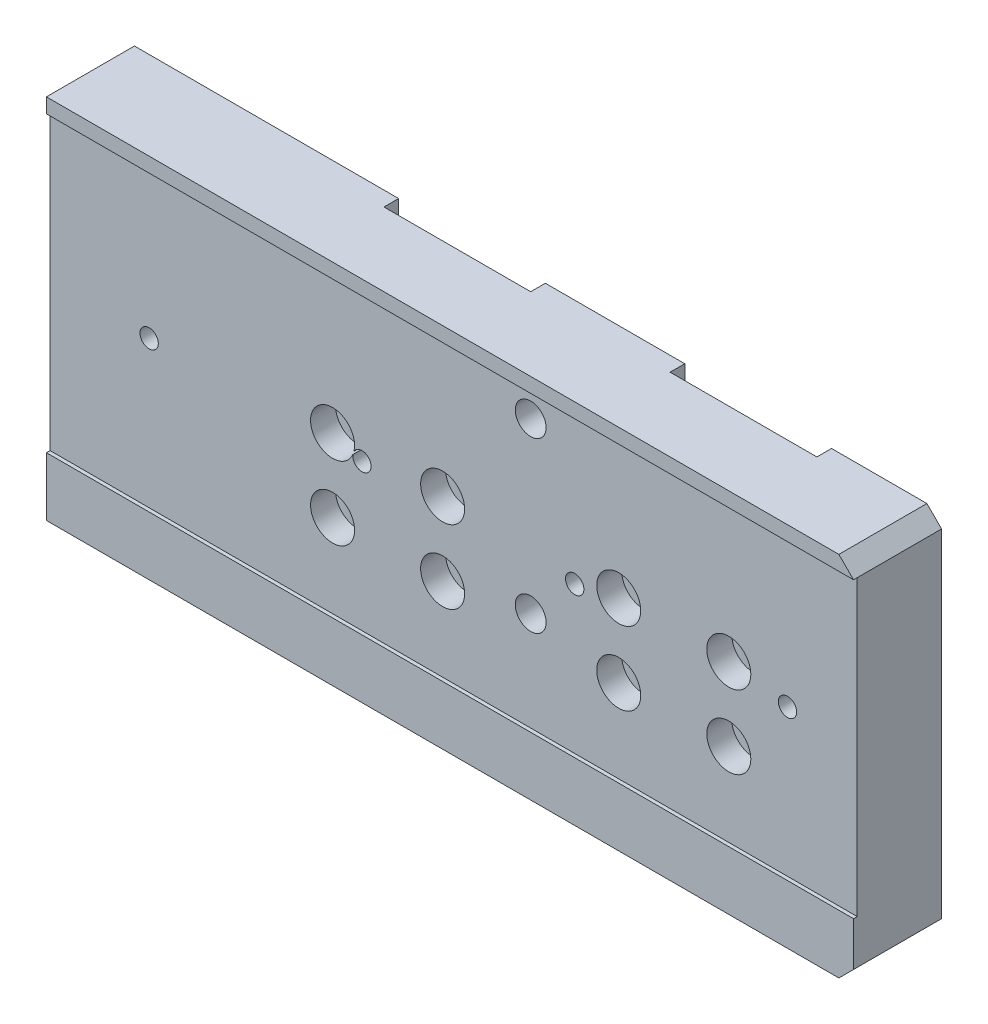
ISO-10303-21;
HEADER;
FILE_DESCRIPTION(('STEP AP214'),'2;1');
FILE_NAME('part.step','',(''),(''),'','','');
FILE_SCHEMA(('AUTOMOTIVE_DESIGN { 1 0 10303 214 1 1 1 1 }'));
ENDSEC;
DATA;
#1=APPLICATION_CONTEXT('core data for automotive mechanical design processes');
#2=APPLICATION_PROTOCOL_DEFINITION('international standard','automotive_design',2000,#1);
#3=PRODUCT_CONTEXT('',#1,'mechanical');
#4=PRODUCT('Part','Part','',(#3));
#5=PRODUCT_RELATED_PRODUCT_CATEGORY('part','',(#4));
#6=PRODUCT_DEFINITION_FORMATION('','',#4);
#7=PRODUCT_DEFINITION_CONTEXT('part definition',#1,'design');
#8=PRODUCT_DEFINITION('design','',#6,#7);
#9=PRODUCT_DEFINITION_SHAPE('','',#8);
#10=(LENGTH_UNIT() NAMED_UNIT(*) SI_UNIT(.MILLI.,.METRE.));
#11=(NAMED_UNIT(*) PLANE_ANGLE_UNIT() SI_UNIT($,.RADIAN.));
#12=(NAMED_UNIT(*) SI_UNIT($,.STERADIAN.) SOLID_ANGLE_UNIT());
#13=UNCERTAINTY_MEASURE_WITH_UNIT(LENGTH_MEASURE(1.E-05),#10,'distance_accuracy_value','');
#14=(GEOMETRIC_REPRESENTATION_CONTEXT(3) GLOBAL_UNCERTAINTY_ASSIGNED_CONTEXT((#13)) GLOBAL_UNIT_ASSIGNED_CONTEXT((#10,
#11,#12)) REPRESENTATION_CONTEXT('',''));
#15=CARTESIAN_POINT('',(0.,0.,0.));
#16=DIRECTION('',(0.,0.,1.));
#17=DIRECTION('',(1.,0.,0.));
#18=AXIS2_PLACEMENT_3D('',#15,#16,#17);
#19=CARTESIAN_POINT('',(79.6880278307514,3.47723542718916,11.5));
#20=DIRECTION('',(0.,0.,-1.));
#21=DIRECTION('',(-1.,0.,0.));
#22=AXIS2_PLACEMENT_3D('',#19,#20,#21);
#23=PLANE('',#22);
#24=CARTESIAN_POINT('',(23.1880278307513,14.8123229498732,11.5));
#25=DIRECTION('',(0.,0.,1.));
#26=DIRECTION('',(1.,0.,0.));
#27=AXIS2_PLACEMENT_3D('',#24,#25,#26);
#28=CIRCLE('',#27,3.);
#29=CARTESIAN_POINT('',(26.1880278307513,14.8123229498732,11.5));
#30=VERTEX_POINT('',#29);
#31=EDGE_CURVE('E195',#30,#30,#28,.T.);
#32=ORIENTED_EDGE('',*,*,#31,.F.);
#33=EDGE_LOOP('',(#32));
#34=FACE_BOUND('',#33,.T.);
#35=DIRECTION('',(0.,-1.,0.));
#36=VECTOR('',#35,1.);
#37=CARTESIAN_POINT('',(-30.3119721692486,3.47723542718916,11.5));
#38=LINE('',#37,#36);
#39=CARTESIAN_POINT('',(-30.3119721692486,43.4772354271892,11.5));
#40=VERTEX_POINT('',#39);
#41=CARTESIAN_POINT('',(-30.3119721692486,3.47723542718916,11.5));
#42=VERTEX_POINT('',#41);
#43=EDGE_CURVE('E368',#40,#42,#38,.T.);
#44=ORIENTED_EDGE('',*,*,#43,.T.);
#45=DIRECTION('',(-1.,0.,0.));
#46=VECTOR('',#45,1.);
#47=CARTESIAN_POINT('',(79.6880278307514,3.47723542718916,11.5));
#48=LINE('',#47,#46);
#49=CARTESIAN_POINT('',(79.6880278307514,3.47723542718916,11.5));
#50=VERTEX_POINT('',#49);
#51=EDGE_CURVE('E376',#50,#42,#48,.T.);
#52=ORIENTED_EDGE('',*,*,#51,.F.);
#53=DIRECTION('',(0.,-1.,0.));
#54=VECTOR('',#53,1.);
#55=CARTESIAN_POINT('',(79.6880278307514,3.47723542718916,11.5));
#56=LINE('',#55,#54);
#57=CARTESIAN_POINT('',(79.6880278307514,43.4772354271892,11.5));
#58=VERTEX_POINT('',#57);
#59=EDGE_CURVE('E358',#58,#50,#56,.T.);
#60=ORIENTED_EDGE('',*,*,#59,.F.);
#61=DIRECTION('',(-1.,0.,0.));
#62=VECTOR('',#61,1.);
#63=CARTESIAN_POINT('',(79.6880278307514,43.4772354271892,11.5));
#64=LINE('',#63,#62);
#65=EDGE_CURVE('E378',#58,#40,#64,.T.);
#66=ORIENTED_EDGE('',*,*,#65,.T.);
#67=EDGE_LOOP('',(#44,#52,#60,#66));
#68=FACE_BOUND('',#67,.T.);
#69=CARTESIAN_POINT('',(-16.8119721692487,23.4772354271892,11.5));
#70=DIRECTION('',(0.,0.,1.));
#71=DIRECTION('',(1.,0.,0.));
#72=AXIS2_PLACEMENT_3D('',#69,#70,#71);
#73=CIRCLE('',#72,1.25);
#74=CARTESIAN_POINT('',(-15.5619721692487,23.4772354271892,11.5));
#75=VERTEX_POINT('',#74);
#76=EDGE_CURVE('E277',#75,#75,#73,.T.);
#77=ORIENTED_EDGE('',*,*,#76,.F.);
#78=EDGE_LOOP('',(#77));
#79=FACE_BOUND('',#78,.T.);
#80=CARTESIAN_POINT('',(41.1880278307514,23.4772354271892,11.5));
#81=DIRECTION('',(0.,0.,1.));
#82=DIRECTION('',(1.,0.,0.));
#83=AXIS2_PLACEMENT_3D('',#80,#81,#82);
#84=CIRCLE('',#83,1.25);
#85=CARTESIAN_POINT('',(42.4380278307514,23.4772354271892,11.5));
#86=VERTEX_POINT('',#85);
#87=EDGE_CURVE('E266',#86,#86,#84,.T.);
#88=ORIENTED_EDGE('',*,*,#87,.F.);
#89=EDGE_LOOP('',(#88));
#90=FACE_BOUND('',#89,.T.);
#91=CARTESIAN_POINT('',(70.1880278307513,23.4772354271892,11.5));
#92=DIRECTION('',(0.,0.,1.));
#93=DIRECTION('',(1.,0.,0.));
#94=AXIS2_PLACEMENT_3D('',#91,#92,#93);
#95=CIRCLE('',#94,1.25);
#96=CARTESIAN_POINT('',(71.4380278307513,23.4772354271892,11.5));
#97=VERTEX_POINT('',#96);
#98=EDGE_CURVE('E260',#97,#97,#95,.T.);
#99=ORIENTED_EDGE('',*,*,#98,.F.);
#100=EDGE_LOOP('',(#99));
#101=FACE_BOUND('',#100,.T.);
#102=CARTESIAN_POINT('',(35.1880278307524,39.9772354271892,11.5));
#103=DIRECTION('',(0.,0.,-1.));
#104=DIRECTION('',(-1.,0.,0.));
#105=AXIS2_PLACEMENT_3D('',#102,#103,#104);
#106=CIRCLE('',#105,2.1);
#107=CARTESIAN_POINT('',(33.0880278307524,39.9772354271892,11.5));
#108=VERTEX_POINT('',#107);
#109=EDGE_CURVE('E257',#108,#108,#106,.T.);
#110=ORIENTED_EDGE('',*,*,#109,.T.);
#111=EDGE_LOOP('',(#110));
#112=FACE_BOUND('',#111,.T.);
#113=CARTESIAN_POINT('',(35.1880278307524,16.9772354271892,11.5));
#114=DIRECTION('',(0.,0.,-1.));
#115=DIRECTION('',(-1.,0.,0.));
#116=AXIS2_PLACEMENT_3D('',#113,#114,#115);
#117=CIRCLE('',#116,2.1);
#118=CARTESIAN_POINT('',(33.0880278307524,16.9772354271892,11.5));
#119=VERTEX_POINT('',#118);
#120=EDGE_CURVE('E253',#119,#119,#117,.T.);
#121=ORIENTED_EDGE('',*,*,#120,.T.);
#122=EDGE_LOOP('',(#121));
#123=FACE_BOUND('',#122,.T.);
#124=CARTESIAN_POINT('',(47.1880278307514,14.8123229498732,11.5));
#125=DIRECTION('',(0.,0.,1.));
#126=DIRECTION('',(1.,0.,0.));
#127=AXIS2_PLACEMENT_3D('',#124,#125,#126);
#128=CIRCLE('',#127,3.);
#129=CARTESIAN_POINT('',(50.1880278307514,14.8123229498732,11.5));
#130=VERTEX_POINT('',#129);
#131=EDGE_CURVE('E240',#130,#130,#128,.T.);
#132=ORIENTED_EDGE('',*,*,#131,.F.);
#133=EDGE_LOOP('',(#132));
#134=FACE_BOUND('',#133,.T.);
#135=CARTESIAN_POINT('',(47.1880278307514,24.8123229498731,11.5));
#136=DIRECTION('',(0.,0.,1.));
#137=DIRECTION('',(1.,0.,0.));
#138=AXIS2_PLACEMENT_3D('',#135,#136,#137);
#139=CIRCLE('',#138,3.);
#140=CARTESIAN_POINT('',(50.1880278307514,24.8123229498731,11.5));
#141=VERTEX_POINT('',#140);
#142=EDGE_CURVE('E230',#141,#141,#139,.T.);
#143=ORIENTED_EDGE('',*,*,#142,.F.);
#144=EDGE_LOOP('',(#143));
#145=FACE_BOUND('',#144,.T.);
#146=CARTESIAN_POINT('',(62.1880278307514,14.8123229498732,11.5));
#147=DIRECTION('',(0.,0.,1.));
#148=DIRECTION('',(1.,0.,0.));
#149=AXIS2_PLACEMENT_3D('',#146,#147,#148);
#150=CIRCLE('',#149,3.);
#151=CARTESIAN_POINT('',(65.1880278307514,14.8123229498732,11.5));
#152=VERTEX_POINT('',#151);
#153=EDGE_CURVE('E220',#152,#152,#150,.T.);
#154=ORIENTED_EDGE('',*,*,#153,.F.);
#155=EDGE_LOOP('',(#154));
#156=FACE_BOUND('',#155,.T.);
#157=CARTESIAN_POINT('',(62.1880278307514,24.8123229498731,11.5));
#158=DIRECTION('',(0.,0.,1.));
#159=DIRECTION('',(1.,0.,0.));
#160=AXIS2_PLACEMENT_3D('',#157,#158,#159);
#161=CIRCLE('',#160,3.);
#162=CARTESIAN_POINT('',(65.1880278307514,24.8123229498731,11.5));
#163=VERTEX_POINT('',#162);
#164=EDGE_CURVE('E210',#163,#163,#161,.T.);
#165=ORIENTED_EDGE('',*,*,#164,.F.);
#166=EDGE_LOOP('',(#165));
#167=FACE_BOUND('',#166,.T.);
#168=CARTESIAN_POINT('',(8.18802783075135,14.8123229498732,11.5));
#169=DIRECTION('',(0.,0.,1.));
#170=DIRECTION('',(1.,0.,0.));
#171=AXIS2_PLACEMENT_3D('',#168,#169,#170);
#172=CIRCLE('',#171,3.);
#173=CARTESIAN_POINT('',(11.1880278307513,14.8123229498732,11.5));
#174=VERTEX_POINT('',#173);
#175=EDGE_CURVE('E182',#174,#174,#172,.T.);
#176=ORIENTED_EDGE('',*,*,#175,.F.);
#177=EDGE_LOOP('',(#176));
#178=FACE_BOUND('',#177,.T.);
#179=CARTESIAN_POINT('',(8.18802783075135,24.8123229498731,11.5));
#180=DIRECTION('',(0.,0.,1.));
#181=DIRECTION('',(1.,0.,0.));
#182=AXIS2_PLACEMENT_3D('',#179,#180,#181);
#183=CIRCLE('',#182,3.);
#184=CARTESIAN_POINT('',(11.100743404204,24.0939303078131,11.5));
#185=VERTEX_POINT('',#184);
#186=CARTESIAN_POINT('',(10.9483092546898,23.6372287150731,11.5));
#187=VERTEX_POINT('',#186);
#188=EDGE_CURVE('E162',#185,#187,#183,.T.);
#189=ORIENTED_EDGE('',*,*,#188,.F.);
#190=CARTESIAN_POINT('',(12.1880278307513,23.4772354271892,11.5));
#191=DIRECTION('',(0.,0.,1.));
#192=DIRECTION('',(1.,0.,0.));
#193=AXIS2_PLACEMENT_3D('',#190,#191,#192);
#194=CIRCLE('',#193,1.25);
#195=EDGE_CURVE('E272',#187,#185,#194,.T.);
#196=ORIENTED_EDGE('',*,*,#195,.F.);
#197=EDGE_LOOP('',(#189,#196));
#198=FACE_BOUND('',#197,.T.);
#199=CARTESIAN_POINT('',(23.1880278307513,24.8123229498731,11.5));
#200=DIRECTION('',(0.,0.,1.));
#201=DIRECTION('',(1.,0.,0.));
#202=AXIS2_PLACEMENT_3D('',#199,#200,#201);
#203=CIRCLE('',#202,3.);
#204=CARTESIAN_POINT('',(26.1880278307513,24.8123229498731,11.5));
#205=VERTEX_POINT('',#204);
#206=EDGE_CURVE('E1046',#205,#205,#203,.T.);
#207=ORIENTED_EDGE('',*,*,#206,.F.);
#208=EDGE_LOOP('',(#207));
#209=FACE_BOUND('',#208,.T.);
#210=ADVANCED_FACE('F16',(#34,#68,#79,#90,#101,#112,#123,#134,#145,#156,#167,#178,#198,#209),
#23,.F.);
#211=CARTESIAN_POINT('',(0.,0.,0.));
#212=DIRECTION('',(0.,0.,-1.));
#213=DIRECTION('',(-1.,0.,0.));
#214=AXIS2_PLACEMENT_3D('',#211,#212,#213);
#215=PLANE('',#214);
#216=CARTESIAN_POINT('',(35.1880278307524,16.9772354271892,0.));
#217=DIRECTION('',(0.,0.,-1.));
#218=DIRECTION('',(-1.,0.,0.));
#219=AXIS2_PLACEMENT_3D('',#216,#217,#218);
#220=CIRCLE('',#219,2.1);
#221=CARTESIAN_POINT('',(33.0880278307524,16.9772354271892,0.));
#222=VERTEX_POINT('',#221);
#223=EDGE_CURVE('E250',#222,#222,#220,.T.);
#224=ORIENTED_EDGE('',*,*,#223,.F.);
#225=EDGE_LOOP('',(#224));
#226=FACE_BOUND('',#225,.T.);
#227=CARTESIAN_POINT('',(35.1880278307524,39.9772354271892,0.));
#228=DIRECTION('',(0.,0.,-1.));
#229=DIRECTION('',(-1.,0.,0.));
#230=AXIS2_PLACEMENT_3D('',#227,#228,#229);
#231=CIRCLE('',#230,2.1);
#232=CARTESIAN_POINT('',(33.0880278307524,39.9772354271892,0.));
#233=VERTEX_POINT('',#232);
#234=EDGE_CURVE('E254',#233,#233,#231,.T.);
#235=ORIENTED_EDGE('',*,*,#234,.F.);
#236=EDGE_LOOP('',(#235));
#237=FACE_BOUND('',#236,.T.);
#238=CARTESIAN_POINT('',(41.1880278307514,23.4772354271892,0.));
#239=DIRECTION('',(0.,0.,1.));
#240=DIRECTION('',(1.,0.,0.));
#241=AXIS2_PLACEMENT_3D('',#238,#239,#240);
#242=CIRCLE('',#241,1.25);
#243=CARTESIAN_POINT('',(42.4380278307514,23.4772354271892,0.));
#244=VERTEX_POINT('',#243);
#245=EDGE_CURVE('E269',#244,#244,#242,.T.);
#246=ORIENTED_EDGE('',*,*,#245,.T.);
#247=EDGE_LOOP('',(#246));
#248=FACE_BOUND('',#247,.T.);
#249=DIRECTION('',(0.,-1.,0.));
#250=VECTOR('',#249,1.);
#251=CARTESIAN_POINT('',(25.6880278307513,45.4772354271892,0.));
#252=LINE('',#251,#250);
#253=CARTESIAN_POINT('',(25.6880278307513,45.4772354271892,0.));
#254=VERTEX_POINT('',#253);
#255=CARTESIAN_POINT('',(25.6880278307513,-4.52276457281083,0.));
#256=VERTEX_POINT('',#255);
#257=EDGE_CURVE('E319',#254,#256,#252,.T.);
#258=ORIENTED_EDGE('',*,*,#257,.F.);
#259=DIRECTION('',(-1.,0.,0.));
#260=VECTOR('',#259,1.);
#261=CARTESIAN_POINT('',(79.6880278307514,45.4772354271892,0.));
#262=LINE('',#261,#260);
#263=CARTESIAN_POINT('',(44.6880278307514,45.4772354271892,0.));
#264=VERTEX_POINT('',#263);
#265=EDGE_CURVE('E399',#264,#254,#262,.T.);
#266=ORIENTED_EDGE('',*,*,#265,.F.);
#267=DIRECTION('',(0.,-1.,0.));
#268=VECTOR('',#267,1.);
#269=CARTESIAN_POINT('',(44.6880278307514,45.4772354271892,0.));
#270=LINE('',#269,#268);
#271=CARTESIAN_POINT('',(44.6880278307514,-4.52276457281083,0.));
#272=VERTEX_POINT('',#271);
#273=EDGE_CURVE('E349',#264,#272,#270,.T.);
#274=ORIENTED_EDGE('',*,*,#273,.T.);
#275=DIRECTION('',(1.,0.,0.));
#276=VECTOR('',#275,1.);
#277=CARTESIAN_POINT('',(79.6880278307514,-4.52276457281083,0.));
#278=LINE('',#277,#276);
#279=EDGE_CURVE('E404',#256,#272,#278,.T.);
#280=ORIENTED_EDGE('',*,*,#279,.F.);
#281=EDGE_LOOP('',(#258,#266,#274,#280));
#282=FACE_BOUND('',#281,.T.);
#283=ADVANCED_FACE('F460',(#226,#237,#248,#282),#215,.T.);
#284=CARTESIAN_POINT('',(70.1880278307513,23.4772354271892,0.));
#285=DIRECTION('',(0.,0.,1.));
#286=DIRECTION('',(1.,0.,0.));
#287=AXIS2_PLACEMENT_3D('',#284,#285,#286);
#288=CIRCLE('',#287,1.25);
#289=CARTESIAN_POINT('',(71.4380278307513,23.4772354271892,0.));
#290=VERTEX_POINT('',#289);
#291=EDGE_CURVE('E263',#290,#290,#288,.T.);
#292=ORIENTED_EDGE('',*,*,#291,.T.);
#293=EDGE_LOOP('',(#292));
#294=FACE_BOUND('',#293,.T.);
#295=CARTESIAN_POINT('',(77.6880278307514,45.4772354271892,0.));
#296=VERTEX_POINT('',#295);
#297=CARTESIAN_POINT('',(64.6880278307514,45.4772354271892,0.));
#298=VERTEX_POINT('',#297);
#299=EDGE_CURVE('E396',#296,#298,#262,.T.);
#300=ORIENTED_EDGE('',*,*,#299,.F.);
#301=DIRECTION('',(-0.707106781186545,0.70710678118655,0.));
#302=VECTOR('',#301,1.);
#303=CARTESIAN_POINT('',(61.5826316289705,61.5826316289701,0.));
#304=LINE('',#303,#302);
#305=CARTESIAN_POINT('',(79.6880278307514,43.4772354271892,0.));
#306=VERTEX_POINT('',#305);
#307=EDGE_CURVE('E415',#296,#306,#304,.F.);
#308=ORIENTED_EDGE('',*,*,#307,.T.);
#309=DIRECTION('',(0.,1.,0.));
#310=VECTOR('',#309,1.);
#311=CARTESIAN_POINT('',(79.6880278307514,45.4772354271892,0.));
#312=LINE('',#311,#310);
#313=CARTESIAN_POINT('',(79.6880278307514,-2.52276457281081,0.));
#314=VERTEX_POINT('',#313);
#315=EDGE_CURVE('E375',#314,#306,#312,.T.);
#316=ORIENTED_EDGE('',*,*,#315,.F.);
#317=DIRECTION('',(0.70710678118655,0.707106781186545,0.));
#318=VECTOR('',#317,1.);
#319=CARTESIAN_POINT('',(41.1053962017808,-41.1053962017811,0.));
#320=LINE('',#319,#318);
#321=CARTESIAN_POINT('',(77.6880278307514,-4.52276457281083,0.));
#322=VERTEX_POINT('',#321);
#323=EDGE_CURVE('E413',#314,#322,#320,.F.);
#324=ORIENTED_EDGE('',*,*,#323,.T.);
#325=CARTESIAN_POINT('',(64.6880278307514,-4.52276457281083,0.));
#326=VERTEX_POINT('',#325);
#327=EDGE_CURVE('E401',#326,#322,#278,.T.);
#328=ORIENTED_EDGE('',*,*,#327,.F.);
#329=DIRECTION('',(0.,-1.,0.));
#330=VECTOR('',#329,1.);
#331=CARTESIAN_POINT('',(64.6880278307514,45.4772354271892,0.));
#332=LINE('',#331,#330);
#333=EDGE_CURVE('E346',#298,#326,#332,.T.);
#334=ORIENTED_EDGE('',*,*,#333,.F.);
#335=EDGE_LOOP('',(#300,#308,#316,#324,#328,#334));
#336=FACE_BOUND('',#335,.T.);
#337=ADVANCED_FACE('F467',(#294,#336),#215,.T.);
#338=CARTESIAN_POINT('',(0.,0.,12.));
#339=DIRECTION('',(0.,0.,-1.));
#340=DIRECTION('',(-1.,0.,0.));
#341=AXIS2_PLACEMENT_3D('',#338,#339,#340);
#342=PLANE('',#341);
#343=DIRECTION('',(1.,0.,0.));
#344=VECTOR('',#343,1.);
#345=CARTESIAN_POINT('',(79.6880278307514,-4.52276457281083,12.));
#346=LINE('',#345,#344);
#347=CARTESIAN_POINT('',(-30.3119721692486,-4.52276457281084,12.));
#348=VERTEX_POINT('',#347);
#349=CARTESIAN_POINT('',(77.6880278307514,-4.52276457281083,12.));
#350=VERTEX_POINT('',#349);
#351=EDGE_CURVE('E390',#348,#350,#346,.T.);
#352=ORIENTED_EDGE('',*,*,#351,.T.);
#353=DIRECTION('',(-0.70710678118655,-0.707106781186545,0.));
#354=VECTOR('',#353,1.);
#355=CARTESIAN_POINT('',(79.6880278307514,-2.52276457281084,12.));
#356=LINE('',#355,#354);
#357=CARTESIAN_POINT('',(79.6880278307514,-2.52276457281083,12.));
#358=VERTEX_POINT('',#357);
#359=EDGE_CURVE('E176',#350,#358,#356,.F.);
#360=ORIENTED_EDGE('',*,*,#359,.T.);
#361=DIRECTION('',(0.,1.,0.));
#362=VECTOR('',#361,1.);
#363=CARTESIAN_POINT('',(79.6880278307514,45.4772354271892,12.));
#364=LINE('',#363,#362);
#365=CARTESIAN_POINT('',(79.6880278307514,3.47723542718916,12.));
#366=VERTEX_POINT('',#365);
#367=EDGE_CURVE('E381',#358,#366,#364,.T.);
#368=ORIENTED_EDGE('',*,*,#367,.T.);
#369=DIRECTION('',(-1.,0.,0.));
#370=VECTOR('',#369,1.);
#371=CARTESIAN_POINT('',(79.6880278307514,3.47723542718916,12.));
#372=LINE('',#371,#370);
#373=CARTESIAN_POINT('',(-30.3119721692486,3.47723542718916,12.));
#374=VERTEX_POINT('',#373);
#375=EDGE_CURVE('E372',#366,#374,#372,.T.);
#376=ORIENTED_EDGE('',*,*,#375,.T.);
#377=DIRECTION('',(0.,-1.,0.));
#378=VECTOR('',#377,1.);
#379=CARTESIAN_POINT('',(-30.3119721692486,45.4772354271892,12.));
#380=LINE('',#379,#378);
#381=EDGE_CURVE('E386',#374,#348,#380,.T.);
#382=ORIENTED_EDGE('',*,*,#381,.T.);
#383=EDGE_LOOP('',(#352,#360,#368,#376,#382));
#384=FACE_BOUND('',#383,.T.);
#385=ADVANCED_FACE('F486',(#384),#342,.F.);
#386=CARTESIAN_POINT('',(79.6880278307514,45.4772354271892,12.));
#387=DIRECTION('',(-1.,0.,0.));
#388=DIRECTION('',(0.,0.,1.));
#389=AXIS2_PLACEMENT_3D('',#386,#387,#388);
#390=PLANE('',#389);
#391=ORIENTED_EDGE('',*,*,#315,.T.);
#392=DIRECTION('',(0.,0.,1.));
#393=VECTOR('',#392,1.);
#394=CARTESIAN_POINT('',(79.6880278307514,43.4772354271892,12.));
#395=LINE('',#394,#393);
#396=EDGE_CURVE('E420',#306,#58,#395,.T.);
#397=ORIENTED_EDGE('',*,*,#396,.T.);
#398=ORIENTED_EDGE('',*,*,#59,.T.);
#399=DIRECTION('',(0.,0.,1.));
#400=VECTOR('',#399,1.);
#401=CARTESIAN_POINT('',(79.6880278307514,3.47723542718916,12.));
#402=LINE('',#401,#400);
#403=EDGE_CURVE('E362',#50,#366,#402,.T.);
#404=ORIENTED_EDGE('',*,*,#403,.T.);
#405=ORIENTED_EDGE('',*,*,#367,.F.);
#406=DIRECTION('',(0.,0.,-1.));
#407=VECTOR('',#406,1.);
#408=CARTESIAN_POINT('',(79.6880278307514,-2.52276457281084,12.));
#409=LINE('',#408,#407);
#410=EDGE_CURVE('E417',#358,#314,#409,.T.);
#411=ORIENTED_EDGE('',*,*,#410,.T.);
#412=EDGE_LOOP('',(#391,#397,#398,#404,#405,#411));
#413=FACE_BOUND('',#412,.T.);
#414=ADVANCED_FACE('F500',(#413),#390,.F.);
#415=CARTESIAN_POINT('',(79.6880278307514,45.4772354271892,12.));
#416=DIRECTION('',(0.,-1.,0.));
#417=DIRECTION('',(1.,0.,0.));
#418=AXIS2_PLACEMENT_3D('',#415,#416,#417);
#419=PLANE('',#418);
#420=DIRECTION('',(-1.,0.,0.));
#421=VECTOR('',#420,1.);
#422=CARTESIAN_POINT('',(79.6880278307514,45.4772354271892,12.));
#423=LINE('',#422,#421);
#424=CARTESIAN_POINT('',(77.6880278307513,45.4772354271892,12.));
#425=VERTEX_POINT('',#424);
#426=CARTESIAN_POINT('',(-30.3119721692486,45.4772354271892,12.));
#427=VERTEX_POINT('',#426);
#428=EDGE_CURVE('E383',#425,#427,#423,.T.);
#429=ORIENTED_EDGE('',*,*,#428,.F.);
#430=DIRECTION('',(0.,0.,-1.));
#431=VECTOR('',#430,1.);
#432=CARTESIAN_POINT('',(77.6880278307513,45.4772354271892,12.));
#433=LINE('',#432,#431);
#434=EDGE_CURVE('E410',#425,#296,#433,.T.);
#435=ORIENTED_EDGE('',*,*,#434,.T.);
#436=ORIENTED_EDGE('',*,*,#299,.T.);
#437=DIRECTION('',(0.,0.,1.));
#438=VECTOR('',#437,1.);
#439=CARTESIAN_POINT('',(64.6880278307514,45.4772354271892,0.));
#440=LINE('',#439,#438);
#441=CARTESIAN_POINT('',(64.6880278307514,45.4772354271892,2.));
#442=VERTEX_POINT('',#441);
#443=EDGE_CURVE('E328',#298,#442,#440,.T.);
#444=ORIENTED_EDGE('',*,*,#443,.T.);
#445=DIRECTION('',(-1.,0.,0.));
#446=VECTOR('',#445,1.);
#447=CARTESIAN_POINT('',(64.6880278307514,45.4772354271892,2.));
#448=LINE('',#447,#446);
#449=CARTESIAN_POINT('',(44.6880278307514,45.4772354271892,2.));
#450=VERTEX_POINT('',#449);
#451=EDGE_CURVE('E331',#442,#450,#448,.T.);
#452=ORIENTED_EDGE('',*,*,#451,.T.);
#453=DIRECTION('',(0.,0.,-1.));
#454=VECTOR('',#453,1.);
#455=CARTESIAN_POINT('',(44.6880278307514,45.4772354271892,0.));
#456=LINE('',#455,#454);
#457=EDGE_CURVE('E335',#450,#264,#456,.T.);
#458=ORIENTED_EDGE('',*,*,#457,.T.);
#459=ORIENTED_EDGE('',*,*,#265,.T.);
#460=DIRECTION('',(0.,0.,1.));
#461=VECTOR('',#460,1.);
#462=CARTESIAN_POINT('',(25.6880278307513,45.4772354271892,0.));
#463=LINE('',#462,#461);
#464=CARTESIAN_POINT('',(25.6880278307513,45.4772354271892,2.));
#465=VERTEX_POINT('',#464);
#466=EDGE_CURVE('E302',#254,#465,#463,.T.);
#467=ORIENTED_EDGE('',*,*,#466,.T.);
#468=DIRECTION('',(-1.,0.,0.));
#469=VECTOR('',#468,1.);
#470=CARTESIAN_POINT('',(25.6880278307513,45.4772354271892,2.));
#471=LINE('',#470,#469);
#472=CARTESIAN_POINT('',(5.68802783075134,45.4772354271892,2.));
#473=VERTEX_POINT('',#472);
#474=EDGE_CURVE('E305',#465,#473,#471,.T.);
#475=ORIENTED_EDGE('',*,*,#474,.T.);
#476=DIRECTION('',(0.,0.,-1.));
#477=VECTOR('',#476,1.);
#478=CARTESIAN_POINT('',(5.68802783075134,45.4772354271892,0.));
#479=LINE('',#478,#477);
#480=CARTESIAN_POINT('',(5.68802783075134,45.4772354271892,0.));
#481=VERTEX_POINT('',#480);
#482=EDGE_CURVE('E309',#473,#481,#479,.T.);
#483=ORIENTED_EDGE('',*,*,#482,.T.);
#484=CARTESIAN_POINT('',(-30.3119721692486,45.4772354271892,0.));
#485=VERTEX_POINT('',#484);
#486=EDGE_CURVE('E395',#481,#485,#262,.T.);
#487=ORIENTED_EDGE('',*,*,#486,.T.);
#488=DIRECTION('',(0.,0.,-1.));
#489=VECTOR('',#488,1.);
#490=CARTESIAN_POINT('',(-30.3119721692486,45.4772354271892,12.));
#491=LINE('',#490,#489);
#492=EDGE_CURVE('E407',#427,#485,#491,.T.);
#493=ORIENTED_EDGE('',*,*,#492,.F.);
#494=EDGE_LOOP('',(#429,#435,#436,#444,#452,#458,#459,#467,#475,#483,#487,#493));
#495=FACE_BOUND('',#494,.T.);
#496=ADVANCED_FACE('F496',(#495),#419,.F.);
#497=CARTESIAN_POINT('',(-30.3119721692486,45.4772354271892,12.));
#498=DIRECTION('',(1.,0.,0.));
#499=DIRECTION('',(0.,1.,0.));
#500=AXIS2_PLACEMENT_3D('',#497,#498,#499);
#501=PLANE('',#500);
#502=ORIENTED_EDGE('',*,*,#381,.F.);
#503=DIRECTION('',(0.,0.,1.));
#504=VECTOR('',#503,1.);
#505=CARTESIAN_POINT('',(-30.3119721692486,3.47723542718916,12.));
#506=LINE('',#505,#504);
#507=EDGE_CURVE('E359',#42,#374,#506,.T.);
#508=ORIENTED_EDGE('',*,*,#507,.F.);
#509=ORIENTED_EDGE('',*,*,#43,.F.);
#510=DIRECTION('',(0.,0.,-1.));
#511=VECTOR('',#510,1.);
#512=CARTESIAN_POINT('',(-30.3119721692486,43.4772354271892,12.));
#513=LINE('',#512,#511);
#514=CARTESIAN_POINT('',(-30.3119721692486,43.4772354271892,12.));
#515=VERTEX_POINT('',#514);
#516=EDGE_CURVE('E348',#515,#40,#513,.T.);
#517=ORIENTED_EDGE('',*,*,#516,.F.);
#518=EDGE_CURVE('E387',#427,#515,#380,.T.);
#519=ORIENTED_EDGE('',*,*,#518,.F.);
#520=ORIENTED_EDGE('',*,*,#492,.T.);
#521=DIRECTION('',(0.,-1.,0.));
#522=VECTOR('',#521,1.);
#523=CARTESIAN_POINT('',(-30.3119721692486,45.4772354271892,0.));
#524=LINE('',#523,#522);
#525=CARTESIAN_POINT('',(-30.3119721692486,-4.52276457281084,0.));
#526=VERTEX_POINT('',#525);
#527=EDGE_CURVE('E398',#485,#526,#524,.T.);
#528=ORIENTED_EDGE('',*,*,#527,.T.);
#529=DIRECTION('',(0.,0.,-1.));
#530=VECTOR('',#529,1.);
#531=CARTESIAN_POINT('',(-30.3119721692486,-4.52276457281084,12.));
#532=LINE('',#531,#530);
#533=EDGE_CURVE('E392',#348,#526,#532,.T.);
#534=ORIENTED_EDGE('',*,*,#533,.F.);
#535=EDGE_LOOP('',(#502,#508,#509,#517,#519,#520,#528,#534));
#536=FACE_BOUND('',#535,.T.);
#537=ADVANCED_FACE('F492',(#536),#501,.F.);
#538=CARTESIAN_POINT('',(79.6880278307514,-4.52276457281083,12.));
#539=DIRECTION('',(0.,1.,0.));
#540=DIRECTION('',(-1.,0.,0.));
#541=AXIS2_PLACEMENT_3D('',#538,#539,#540);
#542=PLANE('',#541);
#543=CARTESIAN_POINT('',(26.6880278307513,-4.52276457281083,6.));
#544=DIRECTION('',(0.,-1.,0.));
#545=DIRECTION('',(0.,0.,-1.));
#546=AXIS2_PLACEMENT_3D('',#543,#544,#545);
#547=CIRCLE('',#546,2.1);
#548=CARTESIAN_POINT('',(26.6880278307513,-4.52276457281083,3.9));
#549=VERTEX_POINT('',#548);
#550=EDGE_CURVE('E283',#549,#549,#547,.T.);
#551=ORIENTED_EDGE('',*,*,#550,.F.);
#552=EDGE_LOOP('',(#551));
#553=FACE_BOUND('',#552,.T.);
#554=CARTESIAN_POINT('',(3.68802783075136,-4.52276457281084,6.));
#555=DIRECTION('',(0.,-1.,0.));
#556=DIRECTION('',(0.,0.,-1.));
#557=AXIS2_PLACEMENT_3D('',#554,#555,#556);
#558=CIRCLE('',#557,2.1);
#559=CARTESIAN_POINT('',(3.68802783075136,-4.52276457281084,3.9));
#560=VERTEX_POINT('',#559);
#561=EDGE_CURVE('E289',#560,#560,#558,.T.);
#562=ORIENTED_EDGE('',*,*,#561,.F.);
#563=EDGE_LOOP('',(#562));
#564=FACE_BOUND('',#563,.T.);
#565=CARTESIAN_POINT('',(-19.3119721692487,-4.52276457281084,6.));
#566=DIRECTION('',(0.,-1.,0.));
#567=DIRECTION('',(0.,0.,-1.));
#568=AXIS2_PLACEMENT_3D('',#565,#566,#567);
#569=CIRCLE('',#568,2.1);
#570=CARTESIAN_POINT('',(-19.3119721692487,-4.52276457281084,3.9));
#571=VERTEX_POINT('',#570);
#572=EDGE_CURVE('E295',#571,#571,#569,.T.);
#573=ORIENTED_EDGE('',*,*,#572,.F.);
#574=EDGE_LOOP('',(#573));
#575=FACE_BOUND('',#574,.T.);
#576=ORIENTED_EDGE('',*,*,#327,.T.);
#577=DIRECTION('',(0.,0.,1.));
#578=VECTOR('',#577,1.);
#579=CARTESIAN_POINT('',(77.6880278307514,-4.52276457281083,12.));
#580=LINE('',#579,#578);
#581=EDGE_CURVE('E41',#322,#350,#580,.T.);
#582=ORIENTED_EDGE('',*,*,#581,.T.);
#583=ORIENTED_EDGE('',*,*,#351,.F.);
#584=ORIENTED_EDGE('',*,*,#533,.T.);
#585=CARTESIAN_POINT('',(5.68802783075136,-4.52276457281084,0.));
#586=VERTEX_POINT('',#585);
#587=EDGE_CURVE('E384',#526,#586,#278,.T.);
#588=ORIENTED_EDGE('',*,*,#587,.T.);
#589=DIRECTION('',(0.,0.,-1.));
#590=VECTOR('',#589,1.);
#591=CARTESIAN_POINT('',(5.68802783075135,-4.52276457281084,0.));
#592=LINE('',#591,#590);
#593=CARTESIAN_POINT('',(5.68802783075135,-4.52276457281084,2.));
#594=VERTEX_POINT('',#593);
#595=EDGE_CURVE('E306',#594,#586,#592,.T.);
#596=ORIENTED_EDGE('',*,*,#595,.F.);
#597=DIRECTION('',(-1.,0.,0.));
#598=VECTOR('',#597,1.);
#599=CARTESIAN_POINT('',(25.6880278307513,-4.52276457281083,2.));
#600=LINE('',#599,#598);
#601=CARTESIAN_POINT('',(25.6880278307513,-4.52276457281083,2.));
#602=VERTEX_POINT('',#601);
#603=EDGE_CURVE('E315',#602,#594,#600,.T.);
#604=ORIENTED_EDGE('',*,*,#603,.F.);
#605=DIRECTION('',(0.,0.,1.));
#606=VECTOR('',#605,1.);
#607=CARTESIAN_POINT('',(25.6880278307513,-4.52276457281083,0.));
#608=LINE('',#607,#606);
#609=EDGE_CURVE('E301',#256,#602,#608,.T.);
#610=ORIENTED_EDGE('',*,*,#609,.F.);
#611=ORIENTED_EDGE('',*,*,#279,.T.);
#612=DIRECTION('',(0.,0.,-1.));
#613=VECTOR('',#612,1.);
#614=CARTESIAN_POINT('',(44.6880278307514,-4.52276457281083,0.));
#615=LINE('',#614,#613);
#616=CARTESIAN_POINT('',(44.6880278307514,-4.52276457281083,2.));
#617=VERTEX_POINT('',#616);
#618=EDGE_CURVE('E332',#617,#272,#615,.T.);
#619=ORIENTED_EDGE('',*,*,#618,.F.);
#620=DIRECTION('',(-1.,0.,0.));
#621=VECTOR('',#620,1.);
#622=CARTESIAN_POINT('',(64.6880278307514,-4.52276457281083,2.));
#623=LINE('',#622,#621);
#624=CARTESIAN_POINT('',(64.6880278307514,-4.52276457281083,2.));
#625=VERTEX_POINT('',#624);
#626=EDGE_CURVE('E341',#625,#617,#623,.T.);
#627=ORIENTED_EDGE('',*,*,#626,.F.);
#628=DIRECTION('',(0.,0.,1.));
#629=VECTOR('',#628,1.);
#630=CARTESIAN_POINT('',(64.6880278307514,-4.52276457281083,0.));
#631=LINE('',#630,#629);
#632=EDGE_CURVE('E321',#326,#625,#631,.T.);
#633=ORIENTED_EDGE('',*,*,#632,.F.);
#634=EDGE_LOOP('',(#576,#582,#583,#584,#588,#596,#604,#610,#611,#619,#627,#633));
#635=FACE_BOUND('',#634,.T.);
#636=ADVANCED_FACE('F484',(#553,#564,#575,#635),#542,.F.);
#637=DIRECTION('',(-1.,0.,0.));
#638=VECTOR('',#637,1.);
#639=CARTESIAN_POINT('',(79.6880278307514,43.4772354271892,12.));
#640=LINE('',#639,#638);
#641=CARTESIAN_POINT('',(79.6880278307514,43.4772354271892,12.));
#642=VERTEX_POINT('',#641);
#643=EDGE_CURVE('E365',#642,#515,#640,.T.);
#644=ORIENTED_EDGE('',*,*,#643,.F.);
#645=DIRECTION('',(0.707106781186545,-0.70710678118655,0.));
#646=VECTOR('',#645,1.);
#647=CARTESIAN_POINT('',(77.6880278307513,45.4772354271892,12.));
#648=LINE('',#647,#646);
#649=EDGE_CURVE('E422',#642,#425,#648,.F.);
#650=ORIENTED_EDGE('',*,*,#649,.T.);
#651=ORIENTED_EDGE('',*,*,#428,.T.);
#652=ORIENTED_EDGE('',*,*,#518,.T.);
#653=EDGE_LOOP('',(#644,#650,#651,#652));
#654=FACE_BOUND('',#653,.T.);
#655=ADVANCED_FACE('F482',(#654),#342,.F.);
#656=CARTESIAN_POINT('',(-16.8119721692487,23.4772354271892,0.));
#657=DIRECTION('',(0.,0.,1.));
#658=DIRECTION('',(1.,0.,0.));
#659=AXIS2_PLACEMENT_3D('',#656,#657,#658);
#660=CIRCLE('',#659,1.25);
#661=CARTESIAN_POINT('',(-15.5619721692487,23.4772354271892,0.));
#662=VERTEX_POINT('',#661);
#663=EDGE_CURVE('E280',#662,#662,#660,.T.);
#664=ORIENTED_EDGE('',*,*,#663,.T.);
#665=EDGE_LOOP('',(#664));
#666=FACE_BOUND('',#665,.T.);
#667=DIRECTION('',(0.,-1.,0.));
#668=VECTOR('',#667,1.);
#669=CARTESIAN_POINT('',(5.68802783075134,45.4772354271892,0.));
#670=LINE('',#669,#668);
#671=EDGE_CURVE('E322',#481,#586,#670,.T.);
#672=ORIENTED_EDGE('',*,*,#671,.T.);
#673=ORIENTED_EDGE('',*,*,#587,.F.);
#674=ORIENTED_EDGE('',*,*,#527,.F.);
#675=ORIENTED_EDGE('',*,*,#486,.F.);
#676=EDGE_LOOP('',(#672,#673,#674,#675));
#677=FACE_BOUND('',#676,.T.);
#678=ADVANCED_FACE('F470',(#666,#677),#215,.T.);
#679=CARTESIAN_POINT('',(79.6880278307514,3.47723542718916,12.));
#680=DIRECTION('',(0.,-1.,0.));
#681=DIRECTION('',(0.,0.,-1.));
#682=AXIS2_PLACEMENT_3D('',#679,#680,#681);
#683=PLANE('',#682);
#684=ORIENTED_EDGE('',*,*,#507,.T.);
#685=ORIENTED_EDGE('',*,*,#375,.F.);
#686=ORIENTED_EDGE('',*,*,#403,.F.);
#687=ORIENTED_EDGE('',*,*,#51,.T.);
#688=EDGE_LOOP('',(#684,#685,#686,#687));
#689=FACE_BOUND('',#688,.T.);
#690=ADVANCED_FACE('F475',(#689),#683,.F.);
#691=CARTESIAN_POINT('',(79.6880278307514,43.4772354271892,12.));
#692=DIRECTION('',(0.,1.,0.));
#693=DIRECTION('',(0.,0.,1.));
#694=AXIS2_PLACEMENT_3D('',#691,#692,#693);
#695=PLANE('',#694);
#696=ORIENTED_EDGE('',*,*,#516,.T.);
#697=ORIENTED_EDGE('',*,*,#65,.F.);
#698=DIRECTION('',(0.,0.,-1.));
#699=VECTOR('',#698,1.);
#700=CARTESIAN_POINT('',(79.6880278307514,43.4772354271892,12.));
#701=LINE('',#700,#699);
#702=EDGE_CURVE('E355',#642,#58,#701,.T.);
#703=ORIENTED_EDGE('',*,*,#702,.F.);
#704=ORIENTED_EDGE('',*,*,#643,.T.);
#705=EDGE_LOOP('',(#696,#697,#703,#704));
#706=FACE_BOUND('',#705,.T.);
#707=ADVANCED_FACE('F477',(#706),#695,.F.);
#708=CARTESIAN_POINT('',(64.6880278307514,45.4772354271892,0.));
#709=DIRECTION('',(1.,0.,0.));
#710=DIRECTION('',(0.,1.,0.));
#711=AXIS2_PLACEMENT_3D('',#708,#709,#710);
#712=PLANE('',#711);
#713=ORIENTED_EDGE('',*,*,#632,.T.);
#714=DIRECTION('',(0.,-1.,0.));
#715=VECTOR('',#714,1.);
#716=CARTESIAN_POINT('',(64.6880278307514,45.4772354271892,2.));
#717=LINE('',#716,#715);
#718=EDGE_CURVE('E338',#442,#625,#717,.T.);
#719=ORIENTED_EDGE('',*,*,#718,.F.);
#720=ORIENTED_EDGE('',*,*,#443,.F.);
#721=ORIENTED_EDGE('',*,*,#333,.T.);
#722=EDGE_LOOP('',(#713,#719,#720,#721));
#723=FACE_BOUND('',#722,.T.);
#724=ADVANCED_FACE('F480',(#723),#712,.F.);
#725=CARTESIAN_POINT('',(44.6880278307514,45.4772354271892,0.));
#726=DIRECTION('',(-1.,0.,0.));
#727=DIRECTION('',(0.,-1.,0.));
#728=AXIS2_PLACEMENT_3D('',#725,#726,#727);
#729=PLANE('',#728);
#730=ORIENTED_EDGE('',*,*,#618,.T.);
#731=ORIENTED_EDGE('',*,*,#273,.F.);
#732=ORIENTED_EDGE('',*,*,#457,.F.);
#733=DIRECTION('',(0.,-1.,0.));
#734=VECTOR('',#733,1.);
#735=CARTESIAN_POINT('',(44.6880278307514,45.4772354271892,2.));
#736=LINE('',#735,#734);
#737=EDGE_CURVE('E352',#450,#617,#736,.T.);
#738=ORIENTED_EDGE('',*,*,#737,.T.);
#739=EDGE_LOOP('',(#730,#731,#732,#738));
#740=FACE_BOUND('',#739,.T.);
#741=ADVANCED_FACE('F589',(#740),#729,.F.);
#742=CARTESIAN_POINT('',(64.6880278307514,45.4772354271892,2.));
#743=DIRECTION('',(0.,0.,1.));
#744=DIRECTION('',(1.,0.,0.));
#745=AXIS2_PLACEMENT_3D('',#742,#743,#744);
#746=PLANE('',#745);
#747=CARTESIAN_POINT('',(62.1880278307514,24.8123229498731,2.));
#748=DIRECTION('',(0.,0.,1.));
#749=DIRECTION('',(1.,0.,0.));
#750=AXIS2_PLACEMENT_3D('',#747,#748,#749);
#751=CIRCLE('',#750,1.7);
#752=CARTESIAN_POINT('',(63.8880278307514,24.8123229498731,2.));
#753=VERTEX_POINT('',#752);
#754=EDGE_CURVE('E219',#753,#753,#751,.T.);
#755=ORIENTED_EDGE('',*,*,#754,.T.);
#756=EDGE_LOOP('',(#755));
#757=FACE_BOUND('',#756,.T.);
#758=CARTESIAN_POINT('',(62.1880278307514,14.8123229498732,2.));
#759=DIRECTION('',(0.,0.,1.));
#760=DIRECTION('',(1.,0.,0.));
#761=AXIS2_PLACEMENT_3D('',#758,#759,#760);
#762=CIRCLE('',#761,1.7);
#763=CARTESIAN_POINT('',(63.8880278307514,14.8123229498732,2.));
#764=VERTEX_POINT('',#763);
#765=EDGE_CURVE('E229',#764,#764,#762,.T.);
#766=ORIENTED_EDGE('',*,*,#765,.T.);
#767=EDGE_LOOP('',(#766));
#768=FACE_BOUND('',#767,.T.);
#769=CARTESIAN_POINT('',(47.1880278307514,24.8123229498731,2.));
#770=DIRECTION('',(0.,0.,1.));
#771=DIRECTION('',(1.,0.,0.));
#772=AXIS2_PLACEMENT_3D('',#769,#770,#771);
#773=CIRCLE('',#772,1.7);
#774=CARTESIAN_POINT('',(48.8880278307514,24.8123229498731,2.));
#775=VERTEX_POINT('',#774);
#776=EDGE_CURVE('E239',#775,#775,#773,.T.);
#777=ORIENTED_EDGE('',*,*,#776,.T.);
#778=EDGE_LOOP('',(#777));
#779=FACE_BOUND('',#778,.T.);
#780=CARTESIAN_POINT('',(47.1880278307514,14.8123229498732,2.));
#781=DIRECTION('',(0.,0.,1.));
#782=DIRECTION('',(1.,0.,0.));
#783=AXIS2_PLACEMENT_3D('',#780,#781,#782);
#784=CIRCLE('',#783,1.7);
#785=CARTESIAN_POINT('',(48.8880278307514,14.8123229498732,2.));
#786=VERTEX_POINT('',#785);
#787=EDGE_CURVE('E249',#786,#786,#784,.T.);
#788=ORIENTED_EDGE('',*,*,#787,.T.);
#789=EDGE_LOOP('',(#788));
#790=FACE_BOUND('',#789,.T.);
#791=ORIENTED_EDGE('',*,*,#626,.T.);
#792=ORIENTED_EDGE('',*,*,#737,.F.);
#793=ORIENTED_EDGE('',*,*,#451,.F.);
#794=ORIENTED_EDGE('',*,*,#718,.T.);
#795=EDGE_LOOP('',(#791,#792,#793,#794));
#796=FACE_BOUND('',#795,.T.);
#797=ADVANCED_FACE('F597',(#757,#768,#779,#790,#796),#746,.F.);
#798=CARTESIAN_POINT('',(25.6880278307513,45.4772354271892,0.));
#799=DIRECTION('',(1.,0.,0.));
#800=DIRECTION('',(0.,0.,-1.));
#801=AXIS2_PLACEMENT_3D('',#798,#799,#800);
#802=PLANE('',#801);
#803=ORIENTED_EDGE('',*,*,#609,.T.);
#804=DIRECTION('',(0.,-1.,0.));
#805=VECTOR('',#804,1.);
#806=CARTESIAN_POINT('',(25.6880278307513,45.4772354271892,2.));
#807=LINE('',#806,#805);
#808=EDGE_CURVE('E312',#465,#602,#807,.T.);
#809=ORIENTED_EDGE('',*,*,#808,.F.);
#810=ORIENTED_EDGE('',*,*,#466,.F.);
#811=ORIENTED_EDGE('',*,*,#257,.T.);
#812=EDGE_LOOP('',(#803,#809,#810,#811));
#813=FACE_BOUND('',#812,.T.);
#814=ADVANCED_FACE('F553',(#813),#802,.F.);
#815=CARTESIAN_POINT('',(5.68802783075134,45.4772354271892,0.));
#816=DIRECTION('',(-1.,0.,0.));
#817=DIRECTION('',(0.,-1.,0.));
#818=AXIS2_PLACEMENT_3D('',#815,#816,#817);
#819=PLANE('',#818);
#820=ORIENTED_EDGE('',*,*,#595,.T.);
#821=ORIENTED_EDGE('',*,*,#671,.F.);
#822=ORIENTED_EDGE('',*,*,#482,.F.);
#823=DIRECTION('',(0.,-1.,0.));
#824=VECTOR('',#823,1.);
#825=CARTESIAN_POINT('',(5.68802783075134,45.4772354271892,2.));
#826=LINE('',#825,#824);
#827=EDGE_CURVE('E325',#473,#594,#826,.T.);
#828=ORIENTED_EDGE('',*,*,#827,.T.);
#829=EDGE_LOOP('',(#820,#821,#822,#828));
#830=FACE_BOUND('',#829,.T.);
#831=ADVANCED_FACE('F560',(#830),#819,.F.);
#832=CARTESIAN_POINT('',(25.6880278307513,45.4772354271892,2.));
#833=DIRECTION('',(0.,0.,1.));
#834=DIRECTION('',(1.,0.,0.));
#835=AXIS2_PLACEMENT_3D('',#832,#833,#834);
#836=PLANE('',#835);
#837=CARTESIAN_POINT('',(23.1880278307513,24.8123229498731,2.));
#838=DIRECTION('',(0.,0.,1.));
#839=DIRECTION('',(1.,0.,0.));
#840=AXIS2_PLACEMENT_3D('',#837,#838,#839);
#841=CIRCLE('',#840,1.7);
#842=CARTESIAN_POINT('',(24.8880278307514,24.8123229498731,2.));
#843=VERTEX_POINT('',#842);
#844=EDGE_CURVE('E20',#843,#843,#841,.T.);
#845=ORIENTED_EDGE('',*,*,#844,.T.);
#846=EDGE_LOOP('',(#845));
#847=FACE_BOUND('',#846,.T.);
#848=CARTESIAN_POINT('',(23.1880278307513,14.8123229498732,2.));
#849=DIRECTION('',(0.,0.,1.));
#850=DIRECTION('',(1.,0.,0.));
#851=AXIS2_PLACEMENT_3D('',#848,#849,#850);
#852=CIRCLE('',#851,1.7);
#853=CARTESIAN_POINT('',(24.8880278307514,14.8123229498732,2.));
#854=VERTEX_POINT('',#853);
#855=EDGE_CURVE('E183',#854,#854,#852,.T.);
#856=ORIENTED_EDGE('',*,*,#855,.T.);
#857=EDGE_LOOP('',(#856));
#858=FACE_BOUND('',#857,.T.);
#859=CARTESIAN_POINT('',(8.18802783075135,24.8123229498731,2.));
#860=DIRECTION('',(0.,0.,1.));
#861=DIRECTION('',(1.,0.,0.));
#862=AXIS2_PLACEMENT_3D('',#859,#860,#861);
#863=CIRCLE('',#862,1.7);
#864=CARTESIAN_POINT('',(9.88802783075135,24.8123229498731,2.));
#865=VERTEX_POINT('',#864);
#866=EDGE_CURVE('E180',#865,#865,#863,.T.);
#867=ORIENTED_EDGE('',*,*,#866,.T.);
#868=EDGE_LOOP('',(#867));
#869=FACE_BOUND('',#868,.T.);
#870=CARTESIAN_POINT('',(8.18802783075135,14.8123229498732,2.));
#871=DIRECTION('',(0.,0.,1.));
#872=DIRECTION('',(1.,0.,0.));
#873=AXIS2_PLACEMENT_3D('',#870,#871,#872);
#874=CIRCLE('',#873,1.7);
#875=CARTESIAN_POINT('',(9.88802783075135,14.8123229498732,2.));
#876=VERTEX_POINT('',#875);
#877=EDGE_CURVE('E209',#876,#876,#874,.T.);
#878=ORIENTED_EDGE('',*,*,#877,.T.);
#879=EDGE_LOOP('',(#878));
#880=FACE_BOUND('',#879,.T.);
#881=CARTESIAN_POINT('',(12.1880278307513,23.4772354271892,2.));
#882=DIRECTION('',(0.,0.,1.));
#883=DIRECTION('',(1.,0.,0.));
#884=AXIS2_PLACEMENT_3D('',#881,#882,#883);
#885=CIRCLE('',#884,1.25);
#886=CARTESIAN_POINT('',(13.4380278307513,23.4772354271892,2.));
#887=VERTEX_POINT('',#886);
#888=EDGE_CURVE('E274',#887,#887,#885,.T.);
#889=ORIENTED_EDGE('',*,*,#888,.T.);
#890=EDGE_LOOP('',(#889));
#891=FACE_BOUND('',#890,.T.);
#892=ORIENTED_EDGE('',*,*,#603,.T.);
#893=ORIENTED_EDGE('',*,*,#827,.F.);
#894=ORIENTED_EDGE('',*,*,#474,.F.);
#895=ORIENTED_EDGE('',*,*,#808,.T.);
#896=EDGE_LOOP('',(#892,#893,#894,#895));
#897=FACE_BOUND('',#896,.T.);
#898=ADVANCED_FACE('F438',(#847,#858,#869,#880,#891,#897),#836,.F.);
#899=CARTESIAN_POINT('',(-19.3119721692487,11.4772354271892,6.));
#900=DIRECTION('',(0.,-1.,0.));
#901=DIRECTION('',(0.,0.,-1.));
#902=AXIS2_PLACEMENT_3D('',#899,#900,#901);
#903=CONICAL_SURFACE('',#902,2.1,1.02974425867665);
#904=CARTESIAN_POINT('',(-19.3119721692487,12.739042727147,6.));
#905=VERTEX_POINT('',#904);
#906=VERTEX_LOOP('',#905);
#907=FACE_BOUND('',#906,.T.);
#908=CARTESIAN_POINT('',(-19.3119721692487,11.4772354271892,6.));
#909=DIRECTION('',(0.,-1.,0.));
#910=DIRECTION('',(0.,0.,-1.));
#911=AXIS2_PLACEMENT_3D('',#908,#909,#910);
#912=CIRCLE('',#911,2.1);
#913=CARTESIAN_POINT('',(-19.3119721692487,11.4772354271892,3.9));
#914=VERTEX_POINT('',#913);
#915=EDGE_CURVE('E298',#914,#914,#912,.T.);
#916=ORIENTED_EDGE('',*,*,#915,.T.);
#917=EDGE_LOOP('',(#916));
#918=FACE_BOUND('',#917,.T.);
#919=ADVANCED_FACE('F628',(#907,#918),#903,.F.);
#920=CARTESIAN_POINT('',(-19.3119721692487,-4.52276457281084,6.));
#921=DIRECTION('',(0.,-1.,0.));
#922=DIRECTION('',(0.,0.,-1.));
#923=AXIS2_PLACEMENT_3D('',#920,#921,#922);
#924=CYLINDRICAL_SURFACE('',#923,2.1);
#925=ORIENTED_EDGE('',*,*,#915,.F.);
#926=EDGE_LOOP('',(#925));
#927=FACE_BOUND('',#926,.T.);
#928=ORIENTED_EDGE('',*,*,#572,.T.);
#929=EDGE_LOOP('',(#928));
#930=FACE_BOUND('',#929,.T.);
#931=ADVANCED_FACE('F637',(#927,#930),#924,.F.);
#932=CARTESIAN_POINT('',(3.68802783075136,11.4772354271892,6.));
#933=DIRECTION('',(0.,-1.,0.));
#934=DIRECTION('',(0.,0.,-1.));
#935=AXIS2_PLACEMENT_3D('',#932,#933,#934);
#936=CONICAL_SURFACE('',#935,2.1,1.02974425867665);
#937=CARTESIAN_POINT('',(3.68802783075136,12.739042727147,6.));
#938=VERTEX_POINT('',#937);
#939=VERTEX_LOOP('',#938);
#940=FACE_BOUND('',#939,.T.);
#941=CARTESIAN_POINT('',(3.68802783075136,11.4772354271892,6.));
#942=DIRECTION('',(0.,-1.,0.));
#943=DIRECTION('',(0.,0.,-1.));
#944=AXIS2_PLACEMENT_3D('',#941,#942,#943);
#945=CIRCLE('',#944,2.1);
#946=CARTESIAN_POINT('',(3.68802783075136,11.4772354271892,3.9));
#947=VERTEX_POINT('',#946);
#948=EDGE_CURVE('E292',#947,#947,#945,.T.);
#949=ORIENTED_EDGE('',*,*,#948,.T.);
#950=EDGE_LOOP('',(#949));
#951=FACE_BOUND('',#950,.T.);
#952=ADVANCED_FACE('F646',(#940,#951),#936,.F.);
#953=CARTESIAN_POINT('',(3.68802783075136,-4.52276457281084,6.));
#954=DIRECTION('',(0.,-1.,0.));
#955=DIRECTION('',(0.,0.,-1.));
#956=AXIS2_PLACEMENT_3D('',#953,#954,#955);
#957=CYLINDRICAL_SURFACE('',#956,2.1);
#958=ORIENTED_EDGE('',*,*,#948,.F.);
#959=EDGE_LOOP('',(#958));
#960=FACE_BOUND('',#959,.T.);
#961=ORIENTED_EDGE('',*,*,#561,.T.);
#962=EDGE_LOOP('',(#961));
#963=FACE_BOUND('',#962,.T.);
#964=ADVANCED_FACE('F655',(#960,#963),#957,.F.);
#965=CARTESIAN_POINT('',(26.6880278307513,11.4772354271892,6.));
#966=DIRECTION('',(0.,-1.,0.));
#967=DIRECTION('',(0.,0.,-1.));
#968=AXIS2_PLACEMENT_3D('',#965,#966,#967);
#969=CONICAL_SURFACE('',#968,2.1,1.02974425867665);
#970=CARTESIAN_POINT('',(26.6880278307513,12.739042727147,6.));
#971=VERTEX_POINT('',#970);
#972=VERTEX_LOOP('',#971);
#973=FACE_BOUND('',#972,.T.);
#974=CARTESIAN_POINT('',(26.6880278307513,11.4772354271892,6.));
#975=DIRECTION('',(0.,-1.,0.));
#976=DIRECTION('',(0.,0.,-1.));
#977=AXIS2_PLACEMENT_3D('',#974,#975,#976);
#978=CIRCLE('',#977,2.1);
#979=CARTESIAN_POINT('',(26.6880278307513,11.4772354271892,3.9));
#980=VERTEX_POINT('',#979);
#981=EDGE_CURVE('E286',#980,#980,#978,.T.);
#982=ORIENTED_EDGE('',*,*,#981,.T.);
#983=EDGE_LOOP('',(#982));
#984=FACE_BOUND('',#983,.T.);
#985=ADVANCED_FACE('F664',(#973,#984),#969,.F.);
#986=CARTESIAN_POINT('',(26.6880278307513,-4.52276457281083,6.));
#987=DIRECTION('',(0.,-1.,0.));
#988=DIRECTION('',(0.,0.,-1.));
#989=AXIS2_PLACEMENT_3D('',#986,#987,#988);
#990=CYLINDRICAL_SURFACE('',#989,2.1);
#991=ORIENTED_EDGE('',*,*,#981,.F.);
#992=EDGE_LOOP('',(#991));
#993=FACE_BOUND('',#992,.T.);
#994=ORIENTED_EDGE('',*,*,#550,.T.);
#995=EDGE_LOOP('',(#994));
#996=FACE_BOUND('',#995,.T.);
#997=ADVANCED_FACE('F673',(#993,#996),#990,.F.);
#998=CARTESIAN_POINT('',(-16.8119721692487,23.4772354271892,11.5));
#999=DIRECTION('',(0.,0.,1.));
#1000=DIRECTION('',(1.,0.,0.));
#1001=AXIS2_PLACEMENT_3D('',#998,#999,#1000);
#1002=CYLINDRICAL_SURFACE('',#1001,1.25);
#1003=ORIENTED_EDGE('',*,*,#663,.F.);
#1004=EDGE_LOOP('',(#1003));
#1005=FACE_BOUND('',#1004,.T.);
#1006=ORIENTED_EDGE('',*,*,#76,.T.);
#1007=EDGE_LOOP('',(#1006));
#1008=FACE_BOUND('',#1007,.T.);
#1009=ADVANCED_FACE('F682',(#1005,#1008),#1002,.F.);
#1010=CARTESIAN_POINT('',(12.1880278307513,23.4772354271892,11.5));
#1011=DIRECTION('',(0.,0.,1.));
#1012=DIRECTION('',(1.,0.,0.));
#1013=AXIS2_PLACEMENT_3D('',#1010,#1011,#1012);
#1014=CYLINDRICAL_SURFACE('',#1013,1.25);
#1015=CARTESIAN_POINT('',(12.1880278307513,23.4772354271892,8.1));
#1016=DIRECTION('',(0.,0.,-1.));
#1017=DIRECTION('',(-1.,0.,0.));
#1018=AXIS2_PLACEMENT_3D('',#1015,#1016,#1017);
#1019=CIRCLE('',#1018,1.25);
#1020=CARTESIAN_POINT('',(11.100743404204,24.0939303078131,8.1));
#1021=VERTEX_POINT('',#1020);
#1022=CARTESIAN_POINT('',(10.9483092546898,23.6372287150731,8.1));
#1023=VERTEX_POINT('',#1022);
#1024=EDGE_CURVE('E25',#1021,#1023,#1019,.F.);
#1025=ORIENTED_EDGE('',*,*,#1024,.T.);
#1026=DIRECTION('',(0.,0.,1.));
#1027=VECTOR('',#1026,1.);
#1028=CARTESIAN_POINT('',(10.9483092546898,23.6372287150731,9.8));
#1029=LINE('',#1028,#1027);
#1030=EDGE_CURVE('E11',#1023,#187,#1029,.T.);
#1031=ORIENTED_EDGE('',*,*,#1030,.T.);
#1032=ORIENTED_EDGE('',*,*,#195,.T.);
#1033=DIRECTION('',(0.,0.,1.));
#1034=VECTOR('',#1033,1.);
#1035=CARTESIAN_POINT('',(11.100743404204,24.0939303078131,9.8));
#1036=LINE('',#1035,#1034);
#1037=EDGE_CURVE('E174',#185,#1021,#1036,.F.);
#1038=ORIENTED_EDGE('',*,*,#1037,.T.);
#1039=EDGE_LOOP('',(#1025,#1031,#1032,#1038));
#1040=FACE_BOUND('',#1039,.T.);
#1041=ORIENTED_EDGE('',*,*,#888,.F.);
#1042=EDGE_LOOP('',(#1041));
#1043=FACE_BOUND('',#1042,.T.);
#1044=ADVANCED_FACE('F172',(#1040,#1043),#1014,.F.);
#1045=CARTESIAN_POINT('',(41.1880278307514,23.4772354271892,11.5));
#1046=DIRECTION('',(0.,0.,1.));
#1047=DIRECTION('',(1.,0.,0.));
#1048=AXIS2_PLACEMENT_3D('',#1045,#1046,#1047);
#1049=CYLINDRICAL_SURFACE('',#1048,1.25);
#1050=ORIENTED_EDGE('',*,*,#245,.F.);
#1051=EDGE_LOOP('',(#1050));
#1052=FACE_BOUND('',#1051,.T.);
#1053=ORIENTED_EDGE('',*,*,#87,.T.);
#1054=EDGE_LOOP('',(#1053));
#1055=FACE_BOUND('',#1054,.T.);
#1056=ADVANCED_FACE('F515',(#1052,#1055),#1049,.F.);
#1057=CARTESIAN_POINT('',(70.1880278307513,23.4772354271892,11.5));
#1058=DIRECTION('',(0.,0.,1.));
#1059=DIRECTION('',(1.,0.,0.));
#1060=AXIS2_PLACEMENT_3D('',#1057,#1058,#1059);
#1061=CYLINDRICAL_SURFACE('',#1060,1.25);
#1062=ORIENTED_EDGE('',*,*,#291,.F.);
#1063=EDGE_LOOP('',(#1062));
#1064=FACE_BOUND('',#1063,.T.);
#1065=ORIENTED_EDGE('',*,*,#98,.T.);
#1066=EDGE_LOOP('',(#1065));
#1067=FACE_BOUND('',#1066,.T.);
#1068=ADVANCED_FACE('F506',(#1064,#1067),#1061,.F.);
#1069=CARTESIAN_POINT('',(77.6880278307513,45.4772354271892,12.));
#1070=DIRECTION('',(-0.70710678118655,-0.707106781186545,0.));
#1071=DIRECTION('',(0.,0.,-1.));
#1072=AXIS2_PLACEMENT_3D('',#1069,#1070,#1071);
#1073=PLANE('',#1072);
#1074=ORIENTED_EDGE('',*,*,#702,.T.);
#1075=ORIENTED_EDGE('',*,*,#396,.F.);
#1076=ORIENTED_EDGE('',*,*,#307,.F.);
#1077=ORIENTED_EDGE('',*,*,#434,.F.);
#1078=ORIENTED_EDGE('',*,*,#649,.F.);
#1079=EDGE_LOOP('',(#1074,#1075,#1076,#1077,#1078));
#1080=FACE_BOUND('',#1079,.T.);
#1081=ADVANCED_FACE('F504',(#1080),#1073,.F.);
#1082=CARTESIAN_POINT('',(79.6880278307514,-2.52276457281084,12.));
#1083=DIRECTION('',(-0.707106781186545,0.70710678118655,0.));
#1084=DIRECTION('',(0.,0.,-1.));
#1085=AXIS2_PLACEMENT_3D('',#1082,#1083,#1084);
#1086=PLANE('',#1085);
#1087=ORIENTED_EDGE('',*,*,#359,.F.);
#1088=ORIENTED_EDGE('',*,*,#581,.F.);
#1089=ORIENTED_EDGE('',*,*,#323,.F.);
#1090=ORIENTED_EDGE('',*,*,#410,.F.);
#1091=EDGE_LOOP('',(#1087,#1088,#1089,#1090));
#1092=FACE_BOUND('',#1091,.T.);
#1093=ADVANCED_FACE('F18',(#1092),#1086,.F.);
#1094=CARTESIAN_POINT('',(35.1880278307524,39.9772354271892,0.));
#1095=DIRECTION('',(0.,0.,-1.));
#1096=DIRECTION('',(-1.,0.,0.));
#1097=AXIS2_PLACEMENT_3D('',#1094,#1095,#1096);
#1098=CYLINDRICAL_SURFACE('',#1097,2.1);
#1099=ORIENTED_EDGE('',*,*,#234,.T.);
#1100=EDGE_LOOP('',(#1099));
#1101=FACE_BOUND('',#1100,.T.);
#1102=ORIENTED_EDGE('',*,*,#109,.F.);
#1103=EDGE_LOOP('',(#1102));
#1104=FACE_BOUND('',#1103,.T.);
#1105=ADVANCED_FACE('F513',(#1101,#1104),#1098,.F.);
#1106=CARTESIAN_POINT('',(35.1880278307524,16.9772354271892,0.));
#1107=DIRECTION('',(0.,0.,-1.));
#1108=DIRECTION('',(-1.,0.,0.));
#1109=AXIS2_PLACEMENT_3D('',#1106,#1107,#1108);
#1110=CYLINDRICAL_SURFACE('',#1109,2.1);
#1111=ORIENTED_EDGE('',*,*,#223,.T.);
#1112=EDGE_LOOP('',(#1111));
#1113=FACE_BOUND('',#1112,.T.);
#1114=ORIENTED_EDGE('',*,*,#120,.F.);
#1115=EDGE_LOOP('',(#1114));
#1116=FACE_BOUND('',#1115,.T.);
#1117=ADVANCED_FACE('F732',(#1113,#1116),#1110,.F.);
#1118=CARTESIAN_POINT('',(47.1880278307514,14.8123229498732,11.5));
#1119=DIRECTION('',(0.,0.,1.));
#1120=DIRECTION('',(1.,0.,0.));
#1121=AXIS2_PLACEMENT_3D('',#1118,#1119,#1120);
#1122=CYLINDRICAL_SURFACE('',#1121,1.7);
#1123=CARTESIAN_POINT('',(47.1880278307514,14.8123229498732,8.1));
#1124=DIRECTION('',(0.,0.,1.));
#1125=DIRECTION('',(1.,0.,0.));
#1126=AXIS2_PLACEMENT_3D('',#1123,#1124,#1125);
#1127=CIRCLE('',#1126,1.7);
#1128=CARTESIAN_POINT('',(48.8880278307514,14.8123229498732,8.1));
#1129=VERTEX_POINT('',#1128);
#1130=EDGE_CURVE('E246',#1129,#1129,#1127,.T.);
#1131=ORIENTED_EDGE('',*,*,#1130,.T.);
#1132=EDGE_LOOP('',(#1131));
#1133=FACE_BOUND('',#1132,.T.);
#1134=ORIENTED_EDGE('',*,*,#787,.F.);
#1135=EDGE_LOOP('',(#1134));
#1136=FACE_BOUND('',#1135,.T.);
#1137=ADVANCED_FACE('F742',(#1133,#1136),#1122,.F.);
#1138=CARTESIAN_POINT('',(48.8880278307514,14.8123229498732,8.1));
#1139=DIRECTION('',(0.,0.,-1.));
#1140=DIRECTION('',(-1.,0.,0.));
#1141=AXIS2_PLACEMENT_3D('',#1138,#1139,#1140);
#1142=PLANE('',#1141);
#1143=ORIENTED_EDGE('',*,*,#1130,.F.);
#1144=EDGE_LOOP('',(#1143));
#1145=FACE_BOUND('',#1144,.T.);
#1146=CARTESIAN_POINT('',(47.1880278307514,14.8123229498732,8.1));
#1147=DIRECTION('',(0.,0.,1.));
#1148=DIRECTION('',(1.,0.,0.));
#1149=AXIS2_PLACEMENT_3D('',#1146,#1147,#1148);
#1150=CIRCLE('',#1149,3.);
#1151=CARTESIAN_POINT('',(50.1880278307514,14.8123229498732,8.1));
#1152=VERTEX_POINT('',#1151);
#1153=EDGE_CURVE('E243',#1152,#1152,#1150,.T.);
#1154=ORIENTED_EDGE('',*,*,#1153,.T.);
#1155=EDGE_LOOP('',(#1154));
#1156=FACE_BOUND('',#1155,.T.);
#1157=ADVANCED_FACE('F752',(#1145,#1156),#1142,.F.);
#1158=CARTESIAN_POINT('',(47.1880278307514,14.8123229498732,11.5));
#1159=DIRECTION('',(0.,0.,1.));
#1160=DIRECTION('',(1.,0.,0.));
#1161=AXIS2_PLACEMENT_3D('',#1158,#1159,#1160);
#1162=CYLINDRICAL_SURFACE('',#1161,3.);
#1163=ORIENTED_EDGE('',*,*,#1153,.F.);
#1164=EDGE_LOOP('',(#1163));
#1165=FACE_BOUND('',#1164,.T.);
#1166=ORIENTED_EDGE('',*,*,#131,.T.);
#1167=EDGE_LOOP('',(#1166));
#1168=FACE_BOUND('',#1167,.T.);
#1169=ADVANCED_FACE('F762',(#1165,#1168),#1162,.F.);
#1170=CARTESIAN_POINT('',(47.1880278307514,24.8123229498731,11.5));
#1171=DIRECTION('',(0.,0.,1.));
#1172=DIRECTION('',(1.,0.,0.));
#1173=AXIS2_PLACEMENT_3D('',#1170,#1171,#1172);
#1174=CYLINDRICAL_SURFACE('',#1173,1.7);
#1175=CARTESIAN_POINT('',(47.1880278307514,24.8123229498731,8.1));
#1176=DIRECTION('',(0.,0.,1.));
#1177=DIRECTION('',(1.,0.,0.));
#1178=AXIS2_PLACEMENT_3D('',#1175,#1176,#1177);
#1179=CIRCLE('',#1178,1.7);
#1180=CARTESIAN_POINT('',(48.8880278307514,24.8123229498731,8.1));
#1181=VERTEX_POINT('',#1180);
#1182=EDGE_CURVE('E236',#1181,#1181,#1179,.T.);
#1183=ORIENTED_EDGE('',*,*,#1182,.T.);
#1184=EDGE_LOOP('',(#1183));
#1185=FACE_BOUND('',#1184,.T.);
#1186=ORIENTED_EDGE('',*,*,#776,.F.);
#1187=EDGE_LOOP('',(#1186));
#1188=FACE_BOUND('',#1187,.T.);
#1189=ADVANCED_FACE('F772',(#1185,#1188),#1174,.F.);
#1190=CARTESIAN_POINT('',(48.8880278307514,24.8123229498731,8.1));
#1191=DIRECTION('',(0.,0.,-1.));
#1192=DIRECTION('',(-1.,0.,0.));
#1193=AXIS2_PLACEMENT_3D('',#1190,#1191,#1192);
#1194=PLANE('',#1193);
#1195=ORIENTED_EDGE('',*,*,#1182,.F.);
#1196=EDGE_LOOP('',(#1195));
#1197=FACE_BOUND('',#1196,.T.);
#1198=CARTESIAN_POINT('',(47.1880278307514,24.8123229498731,8.1));
#1199=DIRECTION('',(0.,0.,1.));
#1200=DIRECTION('',(1.,0.,0.));
#1201=AXIS2_PLACEMENT_3D('',#1198,#1199,#1200);
#1202=CIRCLE('',#1201,3.);
#1203=CARTESIAN_POINT('',(50.1880278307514,24.8123229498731,8.1));
#1204=VERTEX_POINT('',#1203);
#1205=EDGE_CURVE('E233',#1204,#1204,#1202,.T.);
#1206=ORIENTED_EDGE('',*,*,#1205,.T.);
#1207=EDGE_LOOP('',(#1206));
#1208=FACE_BOUND('',#1207,.T.);
#1209=ADVANCED_FACE('F782',(#1197,#1208),#1194,.F.);
#1210=CARTESIAN_POINT('',(47.1880278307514,24.8123229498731,11.5));
#1211=DIRECTION('',(0.,0.,1.));
#1212=DIRECTION('',(1.,0.,0.));
#1213=AXIS2_PLACEMENT_3D('',#1210,#1211,#1212);
#1214=CYLINDRICAL_SURFACE('',#1213,3.);
#1215=ORIENTED_EDGE('',*,*,#1205,.F.);
#1216=EDGE_LOOP('',(#1215));
#1217=FACE_BOUND('',#1216,.T.);
#1218=ORIENTED_EDGE('',*,*,#142,.T.);
#1219=EDGE_LOOP('',(#1218));
#1220=FACE_BOUND('',#1219,.T.);
#1221=ADVANCED_FACE('F792',(#1217,#1220),#1214,.F.);
#1222=CARTESIAN_POINT('',(62.1880278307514,14.8123229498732,11.5));
#1223=DIRECTION('',(0.,0.,1.));
#1224=DIRECTION('',(1.,0.,0.));
#1225=AXIS2_PLACEMENT_3D('',#1222,#1223,#1224);
#1226=CYLINDRICAL_SURFACE('',#1225,1.7);
#1227=CARTESIAN_POINT('',(62.1880278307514,14.8123229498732,8.1));
#1228=DIRECTION('',(0.,0.,1.));
#1229=DIRECTION('',(1.,0.,0.));
#1230=AXIS2_PLACEMENT_3D('',#1227,#1228,#1229);
#1231=CIRCLE('',#1230,1.7);
#1232=CARTESIAN_POINT('',(63.8880278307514,14.8123229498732,8.1));
#1233=VERTEX_POINT('',#1232);
#1234=EDGE_CURVE('E226',#1233,#1233,#1231,.T.);
#1235=ORIENTED_EDGE('',*,*,#1234,.T.);
#1236=EDGE_LOOP('',(#1235));
#1237=FACE_BOUND('',#1236,.T.);
#1238=ORIENTED_EDGE('',*,*,#765,.F.);
#1239=EDGE_LOOP('',(#1238));
#1240=FACE_BOUND('',#1239,.T.);
#1241=ADVANCED_FACE('F802',(#1237,#1240),#1226,.F.);
#1242=CARTESIAN_POINT('',(63.8880278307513,14.8123229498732,8.1));
#1243=DIRECTION('',(0.,0.,-1.));
#1244=DIRECTION('',(-1.,0.,0.));
#1245=AXIS2_PLACEMENT_3D('',#1242,#1243,#1244);
#1246=PLANE('',#1245);
#1247=ORIENTED_EDGE('',*,*,#1234,.F.);
#1248=EDGE_LOOP('',(#1247));
#1249=FACE_BOUND('',#1248,.T.);
#1250=CARTESIAN_POINT('',(62.1880278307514,14.8123229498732,8.1));
#1251=DIRECTION('',(0.,0.,1.));
#1252=DIRECTION('',(1.,0.,0.));
#1253=AXIS2_PLACEMENT_3D('',#1250,#1251,#1252);
#1254=CIRCLE('',#1253,3.);
#1255=CARTESIAN_POINT('',(65.1880278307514,14.8123229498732,8.1));
#1256=VERTEX_POINT('',#1255);
#1257=EDGE_CURVE('E223',#1256,#1256,#1254,.T.);
#1258=ORIENTED_EDGE('',*,*,#1257,.T.);
#1259=EDGE_LOOP('',(#1258));
#1260=FACE_BOUND('',#1259,.T.);
#1261=ADVANCED_FACE('F812',(#1249,#1260),#1246,.F.);
#1262=CARTESIAN_POINT('',(62.1880278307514,14.8123229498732,11.5));
#1263=DIRECTION('',(0.,0.,1.));
#1264=DIRECTION('',(1.,0.,0.));
#1265=AXIS2_PLACEMENT_3D('',#1262,#1263,#1264);
#1266=CYLINDRICAL_SURFACE('',#1265,3.);
#1267=ORIENTED_EDGE('',*,*,#1257,.F.);
#1268=EDGE_LOOP('',(#1267));
#1269=FACE_BOUND('',#1268,.T.);
#1270=ORIENTED_EDGE('',*,*,#153,.T.);
#1271=EDGE_LOOP('',(#1270));
#1272=FACE_BOUND('',#1271,.T.);
#1273=ADVANCED_FACE('F822',(#1269,#1272),#1266,.F.);
#1274=CARTESIAN_POINT('',(62.1880278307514,24.8123229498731,11.5));
#1275=DIRECTION('',(0.,0.,1.));
#1276=DIRECTION('',(1.,0.,0.));
#1277=AXIS2_PLACEMENT_3D('',#1274,#1275,#1276);
#1278=CYLINDRICAL_SURFACE('',#1277,1.7);
#1279=CARTESIAN_POINT('',(62.1880278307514,24.8123229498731,8.1));
#1280=DIRECTION('',(0.,0.,1.));
#1281=DIRECTION('',(1.,0.,0.));
#1282=AXIS2_PLACEMENT_3D('',#1279,#1280,#1281);
#1283=CIRCLE('',#1282,1.7);
#1284=CARTESIAN_POINT('',(63.8880278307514,24.8123229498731,8.1));
#1285=VERTEX_POINT('',#1284);
#1286=EDGE_CURVE('E216',#1285,#1285,#1283,.T.);
#1287=ORIENTED_EDGE('',*,*,#1286,.T.);
#1288=EDGE_LOOP('',(#1287));
#1289=FACE_BOUND('',#1288,.T.);
#1290=ORIENTED_EDGE('',*,*,#754,.F.);
#1291=EDGE_LOOP('',(#1290));
#1292=FACE_BOUND('',#1291,.T.);
#1293=ADVANCED_FACE('F832',(#1289,#1292),#1278,.F.);
#1294=CARTESIAN_POINT('',(63.8880278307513,24.8123229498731,8.1));
#1295=DIRECTION('',(0.,0.,-1.));
#1296=DIRECTION('',(-1.,0.,0.));
#1297=AXIS2_PLACEMENT_3D('',#1294,#1295,#1296);
#1298=PLANE('',#1297);
#1299=ORIENTED_EDGE('',*,*,#1286,.F.);
#1300=EDGE_LOOP('',(#1299));
#1301=FACE_BOUND('',#1300,.T.);
#1302=CARTESIAN_POINT('',(62.1880278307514,24.8123229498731,8.1));
#1303=DIRECTION('',(0.,0.,1.));
#1304=DIRECTION('',(1.,0.,0.));
#1305=AXIS2_PLACEMENT_3D('',#1302,#1303,#1304);
#1306=CIRCLE('',#1305,3.);
#1307=CARTESIAN_POINT('',(65.1880278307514,24.8123229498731,8.1));
#1308=VERTEX_POINT('',#1307);
#1309=EDGE_CURVE('E213',#1308,#1308,#1306,.T.);
#1310=ORIENTED_EDGE('',*,*,#1309,.T.);
#1311=EDGE_LOOP('',(#1310));
#1312=FACE_BOUND('',#1311,.T.);
#1313=ADVANCED_FACE('F456',(#1301,#1312),#1298,.F.);
#1314=CARTESIAN_POINT('',(62.1880278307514,24.8123229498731,11.5));
#1315=DIRECTION('',(0.,0.,1.));
#1316=DIRECTION('',(1.,0.,0.));
#1317=AXIS2_PLACEMENT_3D('',#1314,#1315,#1316);
#1318=CYLINDRICAL_SURFACE('',#1317,3.);
#1319=ORIENTED_EDGE('',*,*,#1309,.F.);
#1320=EDGE_LOOP('',(#1319));
#1321=FACE_BOUND('',#1320,.T.);
#1322=ORIENTED_EDGE('',*,*,#164,.T.);
#1323=EDGE_LOOP('',(#1322));
#1324=FACE_BOUND('',#1323,.T.);
#1325=ADVANCED_FACE('F444',(#1321,#1324),#1318,.F.);
#1326=CARTESIAN_POINT('',(8.18802783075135,14.8123229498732,11.5));
#1327=DIRECTION('',(0.,0.,1.));
#1328=DIRECTION('',(1.,0.,0.));
#1329=AXIS2_PLACEMENT_3D('',#1326,#1327,#1328);
#1330=CYLINDRICAL_SURFACE('',#1329,1.7);
#1331=CARTESIAN_POINT('',(8.18802783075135,14.8123229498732,8.1));
#1332=DIRECTION('',(0.,0.,1.));
#1333=DIRECTION('',(1.,0.,0.));
#1334=AXIS2_PLACEMENT_3D('',#1331,#1332,#1333);
#1335=CIRCLE('',#1334,1.7);
#1336=CARTESIAN_POINT('',(9.88802783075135,14.8123229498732,8.1));
#1337=VERTEX_POINT('',#1336);
#1338=EDGE_CURVE('E206',#1337,#1337,#1335,.T.);
#1339=ORIENTED_EDGE('',*,*,#1338,.T.);
#1340=EDGE_LOOP('',(#1339));
#1341=FACE_BOUND('',#1340,.T.);
#1342=ORIENTED_EDGE('',*,*,#877,.F.);
#1343=EDGE_LOOP('',(#1342));
#1344=FACE_BOUND('',#1343,.T.);
#1345=ADVANCED_FACE('F441',(#1341,#1344),#1330,.F.);
#1346=CARTESIAN_POINT('',(9.88802783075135,14.8123229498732,8.1));
#1347=DIRECTION('',(0.,0.,-1.));
#1348=DIRECTION('',(-1.,0.,0.));
#1349=AXIS2_PLACEMENT_3D('',#1346,#1347,#1348);
#1350=PLANE('',#1349);
#1351=ORIENTED_EDGE('',*,*,#1338,.F.);
#1352=EDGE_LOOP('',(#1351));
#1353=FACE_BOUND('',#1352,.T.);
#1354=CARTESIAN_POINT('',(8.18802783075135,14.8123229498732,8.1));
#1355=DIRECTION('',(0.,0.,1.));
#1356=DIRECTION('',(1.,0.,0.));
#1357=AXIS2_PLACEMENT_3D('',#1354,#1355,#1356);
#1358=CIRCLE('',#1357,3.);
#1359=CARTESIAN_POINT('',(11.1880278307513,14.8123229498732,8.1));
#1360=VERTEX_POINT('',#1359);
#1361=EDGE_CURVE('E203',#1360,#1360,#1358,.T.);
#1362=ORIENTED_EDGE('',*,*,#1361,.T.);
#1363=EDGE_LOOP('',(#1362));
#1364=FACE_BOUND('',#1363,.T.);
#1365=ADVANCED_FACE('F443',(#1353,#1364),#1350,.F.);
#1366=CARTESIAN_POINT('',(8.18802783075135,14.8123229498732,11.5));
#1367=DIRECTION('',(0.,0.,1.));
#1368=DIRECTION('',(1.,0.,0.));
#1369=AXIS2_PLACEMENT_3D('',#1366,#1367,#1368);
#1370=CYLINDRICAL_SURFACE('',#1369,3.);
#1371=ORIENTED_EDGE('',*,*,#1361,.F.);
#1372=EDGE_LOOP('',(#1371));
#1373=FACE_BOUND('',#1372,.T.);
#1374=ORIENTED_EDGE('',*,*,#175,.T.);
#1375=EDGE_LOOP('',(#1374));
#1376=FACE_BOUND('',#1375,.T.);
#1377=ADVANCED_FACE('F453',(#1373,#1376),#1370,.F.);
#1378=CARTESIAN_POINT('',(8.18802783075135,24.8123229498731,11.5));
#1379=DIRECTION('',(0.,0.,1.));
#1380=DIRECTION('',(1.,0.,0.));
#1381=AXIS2_PLACEMENT_3D('',#1378,#1379,#1380);
#1382=CYLINDRICAL_SURFACE('',#1381,1.7);
#1383=CARTESIAN_POINT('',(8.18802783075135,24.8123229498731,8.1));
#1384=DIRECTION('',(0.,0.,1.));
#1385=DIRECTION('',(1.,0.,0.));
#1386=AXIS2_PLACEMENT_3D('',#1383,#1384,#1385);
#1387=CIRCLE('',#1386,1.7);
#1388=CARTESIAN_POINT('',(9.88802783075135,24.8123229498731,8.1));
#1389=VERTEX_POINT('',#1388);
#1390=EDGE_CURVE('E170',#1389,#1389,#1387,.T.);
#1391=ORIENTED_EDGE('',*,*,#1390,.T.);
#1392=EDGE_LOOP('',(#1391));
#1393=FACE_BOUND('',#1392,.T.);
#1394=ORIENTED_EDGE('',*,*,#866,.F.);
#1395=EDGE_LOOP('',(#1394));
#1396=FACE_BOUND('',#1395,.T.);
#1397=ADVANCED_FACE('F876',(#1393,#1396),#1382,.F.);
#1398=CARTESIAN_POINT('',(9.88802783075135,24.8123229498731,8.1));
#1399=DIRECTION('',(0.,0.,-1.));
#1400=DIRECTION('',(-1.,0.,0.));
#1401=AXIS2_PLACEMENT_3D('',#1398,#1399,#1400);
#1402=PLANE('',#1401);
#1403=ORIENTED_EDGE('',*,*,#1390,.F.);
#1404=EDGE_LOOP('',(#1403));
#1405=FACE_BOUND('',#1404,.T.);
#1406=CARTESIAN_POINT('',(8.18802783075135,24.8123229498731,8.1));
#1407=DIRECTION('',(0.,0.,1.));
#1408=DIRECTION('',(1.,0.,0.));
#1409=AXIS2_PLACEMENT_3D('',#1406,#1407,#1408);
#1410=CIRCLE('',#1409,3.);
#1411=EDGE_CURVE('E33',#1021,#1023,#1410,.T.);
#1412=ORIENTED_EDGE('',*,*,#1411,.T.);
#1413=ORIENTED_EDGE('',*,*,#1024,.F.);
#1414=EDGE_LOOP('',(#1412,#1413));
#1415=FACE_BOUND('',#1414,.T.);
#1416=ADVANCED_FACE('F168',(#1405,#1415),#1402,.F.);
#1417=CARTESIAN_POINT('',(8.18802783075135,24.8123229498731,11.5));
#1418=DIRECTION('',(0.,0.,1.));
#1419=DIRECTION('',(1.,0.,0.));
#1420=AXIS2_PLACEMENT_3D('',#1417,#1418,#1419);
#1421=CYLINDRICAL_SURFACE('',#1420,3.);
#1422=ORIENTED_EDGE('',*,*,#1411,.F.);
#1423=ORIENTED_EDGE('',*,*,#1037,.F.);
#1424=ORIENTED_EDGE('',*,*,#188,.T.);
#1425=ORIENTED_EDGE('',*,*,#1030,.F.);
#1426=EDGE_LOOP('',(#1422,#1423,#1424,#1425));
#1427=FACE_BOUND('',#1426,.T.);
#1428=ADVANCED_FACE('F160',(#1427),#1421,.F.);
#1429=CARTESIAN_POINT('',(23.1880278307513,14.8123229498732,11.5));
#1430=DIRECTION('',(0.,0.,1.));
#1431=DIRECTION('',(1.,0.,0.));
#1432=AXIS2_PLACEMENT_3D('',#1429,#1430,#1431);
#1433=CYLINDRICAL_SURFACE('',#1432,1.7);
#1434=CARTESIAN_POINT('',(23.1880278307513,14.8123229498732,8.1));
#1435=DIRECTION('',(0.,0.,1.));
#1436=DIRECTION('',(1.,0.,0.));
#1437=AXIS2_PLACEMENT_3D('',#1434,#1435,#1436);
#1438=CIRCLE('',#1437,1.7);
#1439=CARTESIAN_POINT('',(24.8880278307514,14.8123229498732,8.1));
#1440=VERTEX_POINT('',#1439);
#1441=EDGE_CURVE('E185',#1440,#1440,#1438,.T.);
#1442=ORIENTED_EDGE('',*,*,#1441,.T.);
#1443=EDGE_LOOP('',(#1442));
#1444=FACE_BOUND('',#1443,.T.);
#1445=ORIENTED_EDGE('',*,*,#855,.F.);
#1446=EDGE_LOOP('',(#1445));
#1447=FACE_BOUND('',#1446,.T.);
#1448=ADVANCED_FACE('F904',(#1444,#1447),#1433,.F.);
#1449=CARTESIAN_POINT('',(24.8880278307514,14.8123229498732,8.1));
#1450=DIRECTION('',(0.,0.,-1.));
#1451=DIRECTION('',(-1.,0.,0.));
#1452=AXIS2_PLACEMENT_3D('',#1449,#1450,#1451);
#1453=PLANE('',#1452);
#1454=ORIENTED_EDGE('',*,*,#1441,.F.);
#1455=EDGE_LOOP('',(#1454));
#1456=FACE_BOUND('',#1455,.T.);
#1457=CARTESIAN_POINT('',(23.1880278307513,14.8123229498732,8.1));
#1458=DIRECTION('',(0.,0.,1.));
#1459=DIRECTION('',(1.,0.,0.));
#1460=AXIS2_PLACEMENT_3D('',#1457,#1458,#1459);
#1461=CIRCLE('',#1460,3.);
#1462=CARTESIAN_POINT('',(26.1880278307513,14.8123229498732,8.1));
#1463=VERTEX_POINT('',#1462);
#1464=EDGE_CURVE('E190',#1463,#1463,#1461,.T.);
#1465=ORIENTED_EDGE('',*,*,#1464,.T.);
#1466=EDGE_LOOP('',(#1465));
#1467=FACE_BOUND('',#1466,.T.);
#1468=ADVANCED_FACE('F913',(#1456,#1467),#1453,.F.);
#1469=CARTESIAN_POINT('',(23.1880278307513,14.8123229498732,11.5));
#1470=DIRECTION('',(0.,0.,1.));
#1471=DIRECTION('',(1.,0.,0.));
#1472=AXIS2_PLACEMENT_3D('',#1469,#1470,#1471);
#1473=CYLINDRICAL_SURFACE('',#1472,3.);
#1474=ORIENTED_EDGE('',*,*,#1464,.F.);
#1475=EDGE_LOOP('',(#1474));
#1476=FACE_BOUND('',#1475,.T.);
#1477=ORIENTED_EDGE('',*,*,#31,.T.);
#1478=EDGE_LOOP('',(#1477));
#1479=FACE_BOUND('',#1478,.T.);
#1480=ADVANCED_FACE('F922',(#1476,#1479),#1473,.F.);
#1481=CARTESIAN_POINT('',(23.1880278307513,24.8123229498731,11.5));
#1482=DIRECTION('',(0.,0.,1.));
#1483=DIRECTION('',(1.,0.,0.));
#1484=AXIS2_PLACEMENT_3D('',#1481,#1482,#1483);
#1485=CYLINDRICAL_SURFACE('',#1484,1.7);
#1486=CARTESIAN_POINT('',(23.1880278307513,24.8123229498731,8.1));
#1487=DIRECTION('',(0.,0.,1.));
#1488=DIRECTION('',(1.,0.,0.));
#1489=AXIS2_PLACEMENT_3D('',#1486,#1487,#1488);
#1490=CIRCLE('',#1489,1.7);
#1491=CARTESIAN_POINT('',(24.8880278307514,24.8123229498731,8.1));
#1492=VERTEX_POINT('',#1491);
#1493=EDGE_CURVE('E1051',#1492,#1492,#1490,.T.);
#1494=ORIENTED_EDGE('',*,*,#1493,.T.);
#1495=EDGE_LOOP('',(#1494));
#1496=FACE_BOUND('',#1495,.T.);
#1497=ORIENTED_EDGE('',*,*,#844,.F.);
#1498=EDGE_LOOP('',(#1497));
#1499=FACE_BOUND('',#1498,.T.);
#1500=ADVANCED_FACE('F932',(#1496,#1499),#1485,.F.);
#1501=CARTESIAN_POINT('',(24.8880278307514,24.8123229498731,8.1));
#1502=DIRECTION('',(0.,0.,-1.));
#1503=DIRECTION('',(-1.,0.,0.));
#1504=AXIS2_PLACEMENT_3D('',#1501,#1502,#1503);
#1505=PLANE('',#1504);
#1506=ORIENTED_EDGE('',*,*,#1493,.F.);
#1507=EDGE_LOOP('',(#1506));
#1508=FACE_BOUND('',#1507,.T.);
#1509=CARTESIAN_POINT('',(23.1880278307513,24.8123229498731,8.1));
#1510=DIRECTION('',(0.,0.,1.));
#1511=DIRECTION('',(1.,0.,0.));
#1512=AXIS2_PLACEMENT_3D('',#1509,#1510,#1511);
#1513=CIRCLE('',#1512,3.);
#1514=CARTESIAN_POINT('',(26.1880278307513,24.8123229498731,8.1));
#1515=VERTEX_POINT('',#1514);
#1516=EDGE_CURVE('E1048',#1515,#1515,#1513,.T.);
#1517=ORIENTED_EDGE('',*,*,#1516,.T.);
#1518=EDGE_LOOP('',(#1517));
#1519=FACE_BOUND('',#1518,.T.);
#1520=ADVANCED_FACE('F942',(#1508,#1519),#1505,.F.);
#1521=CARTESIAN_POINT('',(23.1880278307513,24.8123229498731,11.5));
#1522=DIRECTION('',(0.,0.,1.));
#1523=DIRECTION('',(1.,0.,0.));
#1524=AXIS2_PLACEMENT_3D('',#1521,#1522,#1523);
#1525=CYLINDRICAL_SURFACE('',#1524,3.);
#1526=ORIENTED_EDGE('',*,*,#1516,.F.);
#1527=EDGE_LOOP('',(#1526));
#1528=FACE_BOUND('',#1527,.T.);
#1529=ORIENTED_EDGE('',*,*,#206,.T.);
#1530=EDGE_LOOP('',(#1529));
#1531=FACE_BOUND('',#1530,.T.);
#1532=ADVANCED_FACE('F952',(#1528,#1531),#1525,.F.);
#1533=CLOSED_SHELL('',(#210,#283,#337,#385,#414,#496,#537,#636,#655,#678,#690,#707,#724,#741,
#797,#814,#831,#898,#919,#931,#952,#964,#985,#997,#1009,#1044,#1056,#1068,#1081,#1093,#1105,
#1117,#1137,#1157,#1169,#1189,#1209,#1221,#1241,#1261,#1273,#1293,#1313,#1325,#1345,#1365,#1377,
#1397,#1416,#1428,#1448,#1468,#1480,#1500,#1520,#1532));
#1534=MANIFOLD_SOLID_BREP('B1',#1533);
#1535=ADVANCED_BREP_SHAPE_REPRESENTATION('',(#18,#1534),#14);
#1536=SHAPE_DEFINITION_REPRESENTATION(#9,#1535);
ENDSEC;
END-ISO-10303-21;
